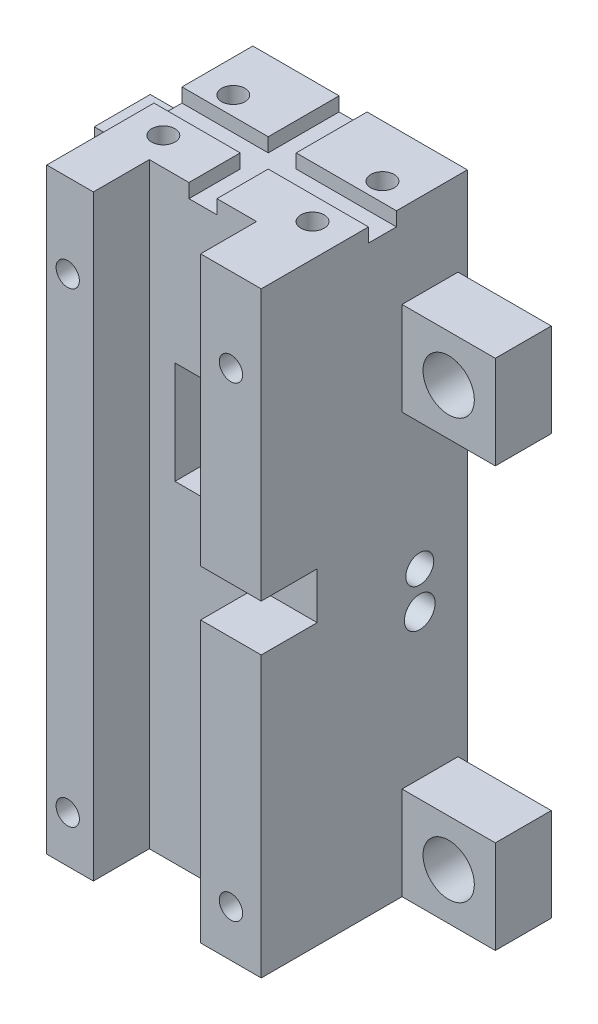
ISO-10303-21;
HEADER;
FILE_DESCRIPTION(('STEP AP214'),'2;1');
FILE_NAME('part.step','',(''),(''),'','','');
FILE_SCHEMA(('AUTOMOTIVE_DESIGN { 1 0 10303 214 1 1 1 1 }'));
ENDSEC;
DATA;
#1=APPLICATION_CONTEXT('core data for automotive mechanical design processes');
#2=APPLICATION_PROTOCOL_DEFINITION('international standard','automotive_design',2000,#1);
#3=PRODUCT_CONTEXT('',#1,'mechanical');
#4=PRODUCT('Part','Part','',(#3));
#5=PRODUCT_RELATED_PRODUCT_CATEGORY('part','',(#4));
#6=PRODUCT_DEFINITION_FORMATION('','',#4);
#7=PRODUCT_DEFINITION_CONTEXT('part definition',#1,'design');
#8=PRODUCT_DEFINITION('design','',#6,#7);
#9=PRODUCT_DEFINITION_SHAPE('','',#8);
#10=(LENGTH_UNIT() NAMED_UNIT(*) SI_UNIT(.MILLI.,.METRE.));
#11=(NAMED_UNIT(*) PLANE_ANGLE_UNIT() SI_UNIT($,.RADIAN.));
#12=(NAMED_UNIT(*) SI_UNIT($,.STERADIAN.) SOLID_ANGLE_UNIT());
#13=UNCERTAINTY_MEASURE_WITH_UNIT(LENGTH_MEASURE(1.E-05),#10,'distance_accuracy_value','');
#14=(GEOMETRIC_REPRESENTATION_CONTEXT(3) GLOBAL_UNCERTAINTY_ASSIGNED_CONTEXT((#13)) GLOBAL_UNIT_ASSIGNED_CONTEXT((#10,
#11,#12)) REPRESENTATION_CONTEXT('',''));
#15=CARTESIAN_POINT('',(0.,0.,0.));
#16=DIRECTION('',(0.,0.,1.));
#17=DIRECTION('',(1.,0.,0.));
#18=AXIS2_PLACEMENT_3D('',#15,#16,#17);
#19=CARTESIAN_POINT('',(-105.888478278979,13.1822327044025,20.1));
#20=DIRECTION('',(1.,0.,0.));
#21=DIRECTION('',(0.,1.,0.));
#22=AXIS2_PLACEMENT_3D('',#19,#20,#21);
#23=PLANE('',#22);
#24=DIRECTION('',(0.,-1.,0.));
#25=VECTOR('',#24,1.);
#26=CARTESIAN_POINT('',(-105.888478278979,-56.8177672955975,-1.));
#27=LINE('',#26,#25);
#28=CARTESIAN_POINT('',(-105.888478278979,-46.8177672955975,-1.));
#29=VERTEX_POINT('',#28);
#30=CARTESIAN_POINT('',(-105.888478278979,-56.8177672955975,-1.));
#31=VERTEX_POINT('',#30);
#32=EDGE_CURVE('E488',#29,#31,#27,.T.);
#33=ORIENTED_EDGE('',*,*,#32,.F.);
#34=DIRECTION('',(0.,0.,-1.));
#35=VECTOR('',#34,1.);
#36=CARTESIAN_POINT('',(-105.888478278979,-46.8177672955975,-1.));
#37=LINE('',#36,#35);
#38=CARTESIAN_POINT('',(-105.888478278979,-46.8177672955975,5.));
#39=VERTEX_POINT('',#38);
#40=EDGE_CURVE('E493',#39,#29,#37,.T.);
#41=ORIENTED_EDGE('',*,*,#40,.F.);
#42=DIRECTION('',(0.,1.,0.));
#43=VECTOR('',#42,1.);
#44=CARTESIAN_POINT('',(-105.888478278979,-56.8177672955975,5.));
#45=LINE('',#44,#43);
#46=CARTESIAN_POINT('',(-105.888478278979,-56.8177672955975,5.));
#47=VERTEX_POINT('',#46);
#48=EDGE_CURVE('E507',#47,#39,#45,.T.);
#49=ORIENTED_EDGE('',*,*,#48,.F.);
#50=DIRECTION('',(0.,0.,-1.));
#51=VECTOR('',#50,1.);
#52=CARTESIAN_POINT('',(-105.888478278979,-56.8177672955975,20.1));
#53=LINE('',#52,#51);
#54=CARTESIAN_POINT('',(-105.888478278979,-56.8177672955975,20.1));
#55=VERTEX_POINT('',#54);
#56=EDGE_CURVE('E531',#55,#47,#53,.T.);
#57=ORIENTED_EDGE('',*,*,#56,.F.);
#58=DIRECTION('',(0.,-1.,0.));
#59=VECTOR('',#58,1.);
#60=CARTESIAN_POINT('',(-105.888478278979,13.1822327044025,20.1));
#61=LINE('',#60,#59);
#62=CARTESIAN_POINT('',(-105.888478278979,7.18223270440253,20.1));
#63=VERTEX_POINT('',#62);
#64=EDGE_CURVE('E1037',#63,#55,#61,.T.);
#65=ORIENTED_EDGE('',*,*,#64,.F.);
#66=DIRECTION('',(0.,0.,-1.));
#67=VECTOR('',#66,1.);
#68=CARTESIAN_POINT('',(-105.888478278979,7.18223270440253,20.1));
#69=LINE('',#68,#67);
#70=CARTESIAN_POINT('',(-105.888478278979,7.18223270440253,8.6));
#71=VERTEX_POINT('',#70);
#72=EDGE_CURVE('E999',#63,#71,#69,.T.);
#73=ORIENTED_EDGE('',*,*,#72,.T.);
#74=DIRECTION('',(0.,-1.,0.));
#75=VECTOR('',#74,1.);
#76=CARTESIAN_POINT('',(-105.888478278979,5.68223270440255,8.6));
#77=LINE('',#76,#75);
#78=CARTESIAN_POINT('',(-105.888478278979,5.68223270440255,8.6));
#79=VERTEX_POINT('',#78);
#80=EDGE_CURVE('E923',#71,#79,#77,.T.);
#81=ORIENTED_EDGE('',*,*,#80,.T.);
#82=DIRECTION('',(0.,0.,-1.));
#83=VECTOR('',#82,1.);
#84=CARTESIAN_POINT('',(-105.888478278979,5.68223270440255,8.6));
#85=LINE('',#84,#83);
#86=CARTESIAN_POINT('',(-105.888478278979,5.68223270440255,5.6));
#87=VERTEX_POINT('',#86);
#88=EDGE_CURVE('E926',#79,#87,#85,.T.);
#89=ORIENTED_EDGE('',*,*,#88,.T.);
#90=DIRECTION('',(0.,1.,0.));
#91=VECTOR('',#90,1.);
#92=CARTESIAN_POINT('',(-105.888478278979,5.68223270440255,5.6));
#93=LINE('',#92,#91);
#94=CARTESIAN_POINT('',(-105.888478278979,7.18223270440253,5.6));
#95=VERTEX_POINT('',#94);
#96=EDGE_CURVE('E930',#87,#95,#93,.T.);
#97=ORIENTED_EDGE('',*,*,#96,.T.);
#98=CARTESIAN_POINT('',(-105.888478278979,7.18223270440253,-2.));
#99=VERTEX_POINT('',#98);
#100=EDGE_CURVE('E998',#95,#99,#69,.T.);
#101=ORIENTED_EDGE('',*,*,#100,.T.);
#102=DIRECTION('',(0.,1.,0.));
#103=VECTOR('',#102,1.);
#104=CARTESIAN_POINT('',(-105.888478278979,-56.8177672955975,-2.));
#105=LINE('',#104,#103);
#106=CARTESIAN_POINT('',(-105.888478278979,-56.8177672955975,-2.));
#107=VERTEX_POINT('',#106);
#108=EDGE_CURVE('E877',#107,#99,#105,.T.);
#109=ORIENTED_EDGE('',*,*,#108,.F.);
#110=EDGE_CURVE('E514',#31,#107,#53,.T.);
#111=ORIENTED_EDGE('',*,*,#110,.F.);
#112=EDGE_LOOP('',(#33,#41,#49,#57,#65,#73,#81,#89,#97,#101,#109,#111));
#113=FACE_BOUND('',#112,.T.);
#114=CARTESIAN_POINT('',(-105.888478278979,-31.3177672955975,3.09999999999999));
#115=DIRECTION('',(-1.,0.,0.));
#116=DIRECTION('',(0.,0.,1.));
#117=AXIS2_PLACEMENT_3D('',#114,#115,#116);
#118=CIRCLE('',#117,1.65);
#119=CARTESIAN_POINT('',(-105.888478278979,-31.3177672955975,4.74999999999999));
#120=VERTEX_POINT('',#119);
#121=EDGE_CURVE('E726',#120,#120,#118,.T.);
#122=ORIENTED_EDGE('',*,*,#121,.F.);
#123=EDGE_LOOP('',(#122));
#124=FACE_BOUND('',#123,.T.);
#125=CARTESIAN_POINT('',(-105.888478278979,-27.3177672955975,3.1));
#126=DIRECTION('',(1.,0.,0.));
#127=DIRECTION('',(0.,0.,-1.));
#128=AXIS2_PLACEMENT_3D('',#125,#126,#127);
#129=CIRCLE('',#128,1.5);
#130=CARTESIAN_POINT('',(-105.888478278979,-27.3177672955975,1.6));
#131=VERTEX_POINT('',#130);
#132=EDGE_CURVE('E537',#131,#131,#129,.T.);
#133=ORIENTED_EDGE('',*,*,#132,.T.);
#134=EDGE_LOOP('',(#133));
#135=FACE_BOUND('',#134,.T.);
#136=DIRECTION('',(0.,-1.,0.));
#137=VECTOR('',#136,1.);
#138=CARTESIAN_POINT('',(-105.888478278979,-1.81776729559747,-1.));
#139=LINE('',#138,#137);
#140=CARTESIAN_POINT('',(-105.888478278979,-1.81776729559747,-1.));
#141=VERTEX_POINT('',#140);
#142=CARTESIAN_POINT('',(-105.888478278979,-11.8177672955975,-0.999999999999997));
#143=VERTEX_POINT('',#142);
#144=EDGE_CURVE('E455',#141,#143,#139,.T.);
#145=ORIENTED_EDGE('',*,*,#144,.F.);
#146=DIRECTION('',(0.,0.,-1.));
#147=VECTOR('',#146,1.);
#148=CARTESIAN_POINT('',(-105.888478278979,-1.81776729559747,-1.));
#149=LINE('',#148,#147);
#150=CARTESIAN_POINT('',(-105.888478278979,-1.81776729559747,5.));
#151=VERTEX_POINT('',#150);
#152=EDGE_CURVE('E460',#151,#141,#149,.T.);
#153=ORIENTED_EDGE('',*,*,#152,.F.);
#154=DIRECTION('',(0.,1.,0.));
#155=VECTOR('',#154,1.);
#156=CARTESIAN_POINT('',(-105.888478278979,-1.81776729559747,5.));
#157=LINE('',#156,#155);
#158=CARTESIAN_POINT('',(-105.888478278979,-11.8177672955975,5.));
#159=VERTEX_POINT('',#158);
#160=EDGE_CURVE('E472',#159,#151,#157,.T.);
#161=ORIENTED_EDGE('',*,*,#160,.F.);
#162=DIRECTION('',(0.,0.,1.));
#163=VECTOR('',#162,1.);
#164=CARTESIAN_POINT('',(-105.888478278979,-11.8177672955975,-0.999999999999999));
#165=LINE('',#164,#163);
#166=EDGE_CURVE('E469',#143,#159,#165,.T.);
#167=ORIENTED_EDGE('',*,*,#166,.F.);
#168=EDGE_LOOP('',(#145,#153,#161,#167));
#169=FACE_BOUND('',#168,.T.);
#170=ADVANCED_FACE('F48',(#113,#124,#135,#169),#23,.F.);
#171=CARTESIAN_POINT('',(-82.8884782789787,7.18223270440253,0.));
#172=DIRECTION('',(0.,-1.,0.));
#173=DIRECTION('',(1.,0.,0.));
#174=AXIS2_PLACEMENT_3D('',#171,#172,#173);
#175=PLANE('',#174);
#176=CARTESIAN_POINT('',(-86.3884782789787,7.18223270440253,11.1));
#177=DIRECTION('',(0.,1.,0.));
#178=DIRECTION('',(0.,0.,1.));
#179=AXIS2_PLACEMENT_3D('',#176,#177,#178);
#180=CIRCLE('',#179,1.24999999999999);
#181=CARTESIAN_POINT('',(-86.3884782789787,7.18223270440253,12.35));
#182=VERTEX_POINT('',#181);
#183=EDGE_CURVE('E898',#182,#182,#180,.T.);
#184=ORIENTED_EDGE('',*,*,#183,.F.);
#185=EDGE_LOOP('',(#184));
#186=FACE_BOUND('',#185,.T.);
#187=DIRECTION('',(0.,0.,1.));
#188=VECTOR('',#187,1.);
#189=CARTESIAN_POINT('',(-82.8884782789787,7.18223270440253,0.));
#190=LINE('',#189,#188);
#191=CARTESIAN_POINT('',(-82.8884782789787,7.18223270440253,8.6));
#192=VERTEX_POINT('',#191);
#193=CARTESIAN_POINT('',(-82.8884782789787,7.18223270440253,20.1));
#194=VERTEX_POINT('',#193);
#195=EDGE_CURVE('E991',#192,#194,#190,.T.);
#196=ORIENTED_EDGE('',*,*,#195,.F.);
#197=DIRECTION('',(1.,0.,0.));
#198=VECTOR('',#197,1.);
#199=CARTESIAN_POINT('',(-105.888478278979,7.18223270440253,8.6));
#200=LINE('',#199,#198);
#201=CARTESIAN_POINT('',(-93.6384782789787,7.18223270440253,8.6));
#202=VERTEX_POINT('',#201);
#203=EDGE_CURVE('E943',#202,#192,#200,.T.);
#204=ORIENTED_EDGE('',*,*,#203,.F.);
#205=DIRECTION('',(0.,0.,1.));
#206=VECTOR('',#205,1.);
#207=CARTESIAN_POINT('',(-93.6384782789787,7.18223270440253,0.));
#208=LINE('',#207,#206);
#209=CARTESIAN_POINT('',(-93.6384782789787,7.18223270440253,14.1));
#210=VERTEX_POINT('',#209);
#211=EDGE_CURVE('E967',#202,#210,#208,.T.);
#212=ORIENTED_EDGE('',*,*,#211,.T.);
#213=DIRECTION('',(-1.,0.,0.));
#214=VECTOR('',#213,1.);
#215=CARTESIAN_POINT('',(-100.888478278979,7.18223270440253,14.1));
#216=LINE('',#215,#214);
#217=CARTESIAN_POINT('',(-89.3884782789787,7.18223270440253,14.1));
#218=VERTEX_POINT('',#217);
#219=EDGE_CURVE('E992',#218,#210,#216,.T.);
#220=ORIENTED_EDGE('',*,*,#219,.F.);
#221=DIRECTION('',(0.,0.,-1.));
#222=VECTOR('',#221,1.);
#223=CARTESIAN_POINT('',(-89.3884782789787,7.18223270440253,-56.8383535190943));
#224=LINE('',#223,#222);
#225=CARTESIAN_POINT('',(-89.3884782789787,7.18223270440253,20.1));
#226=VERTEX_POINT('',#225);
#227=EDGE_CURVE('E1047',#226,#218,#224,.T.);
#228=ORIENTED_EDGE('',*,*,#227,.F.);
#229=DIRECTION('',(1.,0.,0.));
#230=VECTOR('',#229,1.);
#231=CARTESIAN_POINT('',(-82.8884782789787,7.18223270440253,20.1));
#232=LINE('',#231,#230);
#233=EDGE_CURVE('E971',#226,#194,#232,.T.);
#234=ORIENTED_EDGE('',*,*,#233,.T.);
#235=EDGE_LOOP('',(#196,#204,#212,#220,#228,#234));
#236=FACE_BOUND('',#235,.T.);
#237=ADVANCED_FACE('F675',(#186,#236),#175,.F.);
#238=CARTESIAN_POINT('',(-102.388478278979,7.18223270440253,11.1));
#239=DIRECTION('',(0.,1.,0.));
#240=DIRECTION('',(0.,0.,1.));
#241=AXIS2_PLACEMENT_3D('',#238,#239,#240);
#242=CIRCLE('',#241,1.24999999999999);
#243=CARTESIAN_POINT('',(-102.388478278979,7.18223270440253,12.35));
#244=VERTEX_POINT('',#243);
#245=EDGE_CURVE('E897',#244,#244,#242,.T.);
#246=ORIENTED_EDGE('',*,*,#245,.F.);
#247=EDGE_LOOP('',(#246));
#248=FACE_BOUND('',#247,.T.);
#249=DIRECTION('',(0.,0.,1.));
#250=VECTOR('',#249,1.);
#251=CARTESIAN_POINT('',(-96.6384782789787,7.18223270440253,0.));
#252=LINE('',#251,#250);
#253=CARTESIAN_POINT('',(-96.6384782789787,7.18223270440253,8.6));
#254=VERTEX_POINT('',#253);
#255=CARTESIAN_POINT('',(-96.6384782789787,7.18223270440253,14.1));
#256=VERTEX_POINT('',#255);
#257=EDGE_CURVE('E980',#254,#256,#252,.T.);
#258=ORIENTED_EDGE('',*,*,#257,.F.);
#259=EDGE_CURVE('E940',#71,#254,#200,.T.);
#260=ORIENTED_EDGE('',*,*,#259,.F.);
#261=ORIENTED_EDGE('',*,*,#72,.F.);
#262=CARTESIAN_POINT('',(-100.888478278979,7.18223270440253,20.1));
#263=VERTEX_POINT('',#262);
#264=EDGE_CURVE('E986',#63,#263,#232,.T.);
#265=ORIENTED_EDGE('',*,*,#264,.T.);
#266=DIRECTION('',(0.,0.,1.));
#267=VECTOR('',#266,1.);
#268=CARTESIAN_POINT('',(-100.888478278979,7.18223270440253,0.));
#269=LINE('',#268,#267);
#270=CARTESIAN_POINT('',(-100.888478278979,7.18223270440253,14.1));
#271=VERTEX_POINT('',#270);
#272=EDGE_CURVE('E995',#271,#263,#269,.T.);
#273=ORIENTED_EDGE('',*,*,#272,.F.);
#274=EDGE_CURVE('E990',#256,#271,#216,.T.);
#275=ORIENTED_EDGE('',*,*,#274,.F.);
#276=EDGE_LOOP('',(#258,#260,#261,#265,#273,#275));
#277=FACE_BOUND('',#276,.T.);
#278=ADVANCED_FACE('F719',(#248,#277),#175,.F.);
#279=CARTESIAN_POINT('',(-93.6384782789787,5.68223270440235,0.));
#280=DIRECTION('',(1.,0.,0.));
#281=DIRECTION('',(0.,0.,-1.));
#282=AXIS2_PLACEMENT_3D('',#279,#280,#281);
#283=PLANE('',#282);
#284=ORIENTED_EDGE('',*,*,#211,.F.);
#285=DIRECTION('',(0.,-1.,0.));
#286=VECTOR('',#285,1.);
#287=CARTESIAN_POINT('',(-93.6384782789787,5.68223270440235,8.6));
#288=LINE('',#287,#286);
#289=CARTESIAN_POINT('',(-93.6384782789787,5.68223270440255,8.6));
#290=VERTEX_POINT('',#289);
#291=EDGE_CURVE('E955',#202,#290,#288,.T.);
#292=ORIENTED_EDGE('',*,*,#291,.T.);
#293=DIRECTION('',(0.,0.,1.));
#294=VECTOR('',#293,1.);
#295=CARTESIAN_POINT('',(-93.6384782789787,5.68223270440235,0.));
#296=LINE('',#295,#294);
#297=CARTESIAN_POINT('',(-93.6384782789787,5.68223270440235,14.1));
#298=VERTEX_POINT('',#297);
#299=EDGE_CURVE('E972',#290,#298,#296,.T.);
#300=ORIENTED_EDGE('',*,*,#299,.T.);
#301=DIRECTION('',(0.,1.,0.));
#302=VECTOR('',#301,1.);
#303=CARTESIAN_POINT('',(-93.6384782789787,5.68223270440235,14.1));
#304=LINE('',#303,#302);
#305=EDGE_CURVE('E958',#298,#210,#304,.T.);
#306=ORIENTED_EDGE('',*,*,#305,.T.);
#307=EDGE_LOOP('',(#284,#292,#300,#306));
#308=FACE_BOUND('',#307,.T.);
#309=ADVANCED_FACE('F670',(#308),#283,.F.);
#310=CARTESIAN_POINT('',(-96.6384782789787,5.68223270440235,0.));
#311=DIRECTION('',(-1.,0.,0.));
#312=DIRECTION('',(0.,0.,1.));
#313=AXIS2_PLACEMENT_3D('',#310,#311,#312);
#314=PLANE('',#313);
#315=DIRECTION('',(0.,0.,1.));
#316=VECTOR('',#315,1.);
#317=CARTESIAN_POINT('',(-96.6384782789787,5.68223270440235,0.));
#318=LINE('',#317,#316);
#319=CARTESIAN_POINT('',(-96.6384782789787,5.68223270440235,8.6));
#320=VERTEX_POINT('',#319);
#321=CARTESIAN_POINT('',(-96.6384782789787,5.68223270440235,14.1));
#322=VERTEX_POINT('',#321);
#323=EDGE_CURVE('E976',#320,#322,#318,.T.);
#324=ORIENTED_EDGE('',*,*,#323,.F.);
#325=DIRECTION('',(0.,1.,0.));
#326=VECTOR('',#325,1.);
#327=CARTESIAN_POINT('',(-96.6384782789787,5.68223270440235,8.6));
#328=LINE('',#327,#326);
#329=EDGE_CURVE('E619',#320,#254,#328,.T.);
#330=ORIENTED_EDGE('',*,*,#329,.T.);
#331=ORIENTED_EDGE('',*,*,#257,.T.);
#332=DIRECTION('',(0.,-1.,0.));
#333=VECTOR('',#332,1.);
#334=CARTESIAN_POINT('',(-96.6384782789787,5.68223270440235,14.1));
#335=LINE('',#334,#333);
#336=EDGE_CURVE('E961',#256,#322,#335,.T.);
#337=ORIENTED_EDGE('',*,*,#336,.T.);
#338=EDGE_LOOP('',(#324,#330,#331,#337));
#339=FACE_BOUND('',#338,.T.);
#340=ADVANCED_FACE('F665',(#339),#314,.F.);
#341=CARTESIAN_POINT('',(-86.3884782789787,7.18223270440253,3.6));
#342=DIRECTION('',(0.,1.,0.));
#343=DIRECTION('',(0.,0.,1.));
#344=AXIS2_PLACEMENT_3D('',#341,#342,#343);
#345=CIRCLE('',#344,1.24999999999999);
#346=CARTESIAN_POINT('',(-86.3884782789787,7.18223270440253,4.84999999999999));
#347=VERTEX_POINT('',#346);
#348=EDGE_CURVE('E916',#347,#347,#345,.T.);
#349=ORIENTED_EDGE('',*,*,#348,.F.);
#350=EDGE_LOOP('',(#349));
#351=FACE_BOUND('',#350,.T.);
#352=CARTESIAN_POINT('',(-93.6384782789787,7.18223270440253,-2.));
#353=VERTEX_POINT('',#352);
#354=CARTESIAN_POINT('',(-93.6384782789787,7.18223270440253,5.6));
#355=VERTEX_POINT('',#354);
#356=EDGE_CURVE('E981',#353,#355,#208,.T.);
#357=ORIENTED_EDGE('',*,*,#356,.T.);
#358=DIRECTION('',(1.,0.,0.));
#359=VECTOR('',#358,1.);
#360=CARTESIAN_POINT('',(-105.888478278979,7.18223270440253,5.6));
#361=LINE('',#360,#359);
#362=CARTESIAN_POINT('',(-82.8884782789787,7.18223270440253,5.6));
#363=VERTEX_POINT('',#362);
#364=EDGE_CURVE('E947',#355,#363,#361,.T.);
#365=ORIENTED_EDGE('',*,*,#364,.T.);
#366=CARTESIAN_POINT('',(-82.8884782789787,7.18223270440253,-2.));
#367=VERTEX_POINT('',#366);
#368=EDGE_CURVE('E987',#367,#363,#190,.T.);
#369=ORIENTED_EDGE('',*,*,#368,.F.);
#370=DIRECTION('',(1.,0.,0.));
#371=VECTOR('',#370,1.);
#372=CARTESIAN_POINT('',(-93.6384782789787,7.18223270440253,-2.));
#373=LINE('',#372,#371);
#374=EDGE_CURVE('E867',#353,#367,#373,.T.);
#375=ORIENTED_EDGE('',*,*,#374,.F.);
#376=EDGE_LOOP('',(#357,#365,#369,#375));
#377=FACE_BOUND('',#376,.T.);
#378=ADVANCED_FACE('F676',(#351,#377),#175,.F.);
#379=CARTESIAN_POINT('',(0.,0.,20.1));
#380=DIRECTION('',(0.,0.,1.));
#381=DIRECTION('',(1.,0.,0.));
#382=AXIS2_PLACEMENT_3D('',#379,#380,#381);
#383=PLANE('',#382);
#384=CARTESIAN_POINT('',(-86.1384782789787,-1.81776729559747,20.1));
#385=DIRECTION('',(0.,0.,1.));
#386=DIRECTION('',(1.,0.,0.));
#387=AXIS2_PLACEMENT_3D('',#384,#385,#386);
#388=CIRCLE('',#387,1.24999999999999);
#389=CARTESIAN_POINT('',(-84.8884782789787,-1.81776729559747,20.1));
#390=VERTEX_POINT('',#389);
#391=EDGE_CURVE('E882',#390,#390,#388,.T.);
#392=ORIENTED_EDGE('',*,*,#391,.F.);
#393=EDGE_LOOP('',(#392));
#394=FACE_BOUND('',#393,.T.);
#395=ORIENTED_EDGE('',*,*,#233,.F.);
#396=DIRECTION('',(0.,1.,0.));
#397=VECTOR('',#396,1.);
#398=CARTESIAN_POINT('',(-89.3884782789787,-56.8177672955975,20.1));
#399=LINE('',#398,#397);
#400=CARTESIAN_POINT('',(-89.3884782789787,-21.8177672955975,20.1));
#401=VERTEX_POINT('',#400);
#402=EDGE_CURVE('E1002',#401,#226,#399,.T.);
#403=ORIENTED_EDGE('',*,*,#402,.F.);
#404=DIRECTION('',(1.,0.,0.));
#405=VECTOR('',#404,1.);
#406=CARTESIAN_POINT('',(-100.888478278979,-21.8177672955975,20.1));
#407=LINE('',#406,#405);
#408=CARTESIAN_POINT('',(-82.8884782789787,-21.8177672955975,20.1));
#409=VERTEX_POINT('',#408);
#410=EDGE_CURVE('E1035',#401,#409,#407,.T.);
#411=ORIENTED_EDGE('',*,*,#410,.T.);
#412=DIRECTION('',(0.,1.,0.));
#413=VECTOR('',#412,1.);
#414=CARTESIAN_POINT('',(-82.8884782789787,13.1822327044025,20.1));
#415=LINE('',#414,#413);
#416=EDGE_CURVE('E1066',#409,#194,#415,.T.);
#417=ORIENTED_EDGE('',*,*,#416,.T.);
#418=EDGE_LOOP('',(#395,#403,#411,#417));
#419=FACE_BOUND('',#418,.T.);
#420=ADVANCED_FACE('F702',(#394,#419),#383,.T.);
#421=CARTESIAN_POINT('',(-86.1384782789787,-51.8177672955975,20.1));
#422=DIRECTION('',(0.,0.,1.));
#423=DIRECTION('',(1.,0.,0.));
#424=AXIS2_PLACEMENT_3D('',#421,#422,#423);
#425=CIRCLE('',#424,1.24999999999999);
#426=CARTESIAN_POINT('',(-84.8884782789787,-51.8177672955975,20.1));
#427=VERTEX_POINT('',#426);
#428=EDGE_CURVE('E598',#427,#427,#425,.T.);
#429=ORIENTED_EDGE('',*,*,#428,.F.);
#430=EDGE_LOOP('',(#429));
#431=FACE_BOUND('',#430,.T.);
#432=CARTESIAN_POINT('',(-89.3884782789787,-56.8177672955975,20.1));
#433=VERTEX_POINT('',#432);
#434=CARTESIAN_POINT('',(-89.3884782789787,-26.8177672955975,20.1));
#435=VERTEX_POINT('',#434);
#436=EDGE_CURVE('E1003',#433,#435,#399,.T.);
#437=ORIENTED_EDGE('',*,*,#436,.F.);
#438=DIRECTION('',(1.,0.,0.));
#439=VECTOR('',#438,1.);
#440=CARTESIAN_POINT('',(-105.888478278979,-56.8177672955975,20.1));
#441=LINE('',#440,#439);
#442=CARTESIAN_POINT('',(-82.8884782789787,-56.8177672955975,20.1));
#443=VERTEX_POINT('',#442);
#444=EDGE_CURVE('E1046',#433,#443,#441,.T.);
#445=ORIENTED_EDGE('',*,*,#444,.T.);
#446=CARTESIAN_POINT('',(-82.8884782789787,-26.8177672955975,20.1));
#447=VERTEX_POINT('',#446);
#448=EDGE_CURVE('E520',#443,#447,#415,.T.);
#449=ORIENTED_EDGE('',*,*,#448,.T.);
#450=DIRECTION('',(1.,0.,0.));
#451=VECTOR('',#450,1.);
#452=CARTESIAN_POINT('',(-100.888478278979,-26.8177672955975,20.1));
#453=LINE('',#452,#451);
#454=EDGE_CURVE('E1027',#435,#447,#453,.T.);
#455=ORIENTED_EDGE('',*,*,#454,.F.);
#456=EDGE_LOOP('',(#437,#445,#449,#455));
#457=FACE_BOUND('',#456,.T.);
#458=ADVANCED_FACE('F703',(#431,#457),#383,.T.);
#459=CARTESIAN_POINT('',(-105.888478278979,-56.8177672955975,20.1));
#460=DIRECTION('',(0.,1.,0.));
#461=DIRECTION('',(0.,0.,1.));
#462=AXIS2_PLACEMENT_3D('',#459,#460,#461);
#463=PLANE('',#462);
#464=DIRECTION('',(-1.,0.,0.));
#465=VECTOR('',#464,1.);
#466=CARTESIAN_POINT('',(-82.8884782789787,-56.8177672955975,-2.));
#467=LINE('',#466,#465);
#468=CARTESIAN_POINT('',(-98.1384782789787,-56.8177672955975,-2.));
#469=VERTEX_POINT('',#468);
#470=EDGE_CURVE('E873',#469,#107,#467,.T.);
#471=ORIENTED_EDGE('',*,*,#470,.F.);
#472=DIRECTION('',(0.,0.,-1.));
#473=VECTOR('',#472,1.);
#474=CARTESIAN_POINT('',(-98.1384782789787,-56.8177672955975,8.));
#475=LINE('',#474,#473);
#476=CARTESIAN_POINT('',(-98.1384782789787,-56.8177672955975,8.));
#477=VERTEX_POINT('',#476);
#478=EDGE_CURVE('E836',#477,#469,#475,.T.);
#479=ORIENTED_EDGE('',*,*,#478,.F.);
#480=DIRECTION('',(-1.,0.,0.));
#481=VECTOR('',#480,1.);
#482=CARTESIAN_POINT('',(-98.1384782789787,-56.8177672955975,8.));
#483=LINE('',#482,#481);
#484=CARTESIAN_POINT('',(-92.1384782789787,-56.8177672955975,8.));
#485=VERTEX_POINT('',#484);
#486=EDGE_CURVE('E1127',#485,#477,#483,.T.);
#487=ORIENTED_EDGE('',*,*,#486,.F.);
#488=DIRECTION('',(0.,0.,-1.));
#489=VECTOR('',#488,1.);
#490=CARTESIAN_POINT('',(-92.1384782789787,-56.8177672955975,8.));
#491=LINE('',#490,#489);
#492=CARTESIAN_POINT('',(-92.1384782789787,-56.8177672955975,-2.));
#493=VERTEX_POINT('',#492);
#494=EDGE_CURVE('E1130',#485,#493,#491,.T.);
#495=ORIENTED_EDGE('',*,*,#494,.T.);
#496=CARTESIAN_POINT('',(-82.8884782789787,-56.8177672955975,-2.));
#497=VERTEX_POINT('',#496);
#498=EDGE_CURVE('E874',#497,#493,#467,.T.);
#499=ORIENTED_EDGE('',*,*,#498,.F.);
#500=DIRECTION('',(0.,0.,-1.));
#501=VECTOR('',#500,1.);
#502=CARTESIAN_POINT('',(-82.8884782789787,-56.8177672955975,20.1));
#503=LINE('',#502,#501);
#504=CARTESIAN_POINT('',(-82.8884782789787,-56.8177672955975,-1.));
#505=VERTEX_POINT('',#504);
#506=EDGE_CURVE('E515',#505,#497,#503,.T.);
#507=ORIENTED_EDGE('',*,*,#506,.F.);
#508=DIRECTION('',(-1.,0.,0.));
#509=VECTOR('',#508,1.);
#510=CARTESIAN_POINT('',(-72.8884782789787,-56.8177672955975,-1.));
#511=LINE('',#510,#509);
#512=CARTESIAN_POINT('',(-72.8884782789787,-56.8177672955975,-1.));
#513=VERTEX_POINT('',#512);
#514=EDGE_CURVE('E444',#513,#505,#511,.T.);
#515=ORIENTED_EDGE('',*,*,#514,.F.);
#516=DIRECTION('',(0.,0.,1.));
#517=VECTOR('',#516,1.);
#518=CARTESIAN_POINT('',(-72.8884782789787,-56.8177672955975,-1.));
#519=LINE('',#518,#517);
#520=CARTESIAN_POINT('',(-72.8884782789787,-56.8177672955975,5.));
#521=VERTEX_POINT('',#520);
#522=EDGE_CURVE('E442',#513,#521,#519,.T.);
#523=ORIENTED_EDGE('',*,*,#522,.T.);
#524=DIRECTION('',(-1.,0.,0.));
#525=VECTOR('',#524,1.);
#526=CARTESIAN_POINT('',(-72.8884782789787,-56.8177672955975,5.));
#527=LINE('',#526,#525);
#528=CARTESIAN_POINT('',(-82.8884782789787,-56.8177672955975,5.));
#529=VERTEX_POINT('',#528);
#530=EDGE_CURVE('E453',#521,#529,#527,.T.);
#531=ORIENTED_EDGE('',*,*,#530,.T.);
#532=EDGE_CURVE('E510',#443,#529,#503,.T.);
#533=ORIENTED_EDGE('',*,*,#532,.F.);
#534=ORIENTED_EDGE('',*,*,#444,.F.);
#535=DIRECTION('',(0.,0.,1.));
#536=VECTOR('',#535,1.);
#537=CARTESIAN_POINT('',(-89.3884782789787,-56.8177672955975,-56.8383535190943));
#538=LINE('',#537,#536);
#539=CARTESIAN_POINT('',(-89.3884782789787,-56.8177672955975,14.1));
#540=VERTEX_POINT('',#539);
#541=EDGE_CURVE('E1008',#540,#433,#538,.T.);
#542=ORIENTED_EDGE('',*,*,#541,.F.);
#543=DIRECTION('',(1.,0.,0.));
#544=VECTOR('',#543,1.);
#545=CARTESIAN_POINT('',(-100.888478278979,-56.8177672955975,14.1));
#546=LINE('',#545,#544);
#547=CARTESIAN_POINT('',(-100.888478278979,-56.8177672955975,14.1));
#548=VERTEX_POINT('',#547);
#549=EDGE_CURVE('E1005',#548,#540,#546,.T.);
#550=ORIENTED_EDGE('',*,*,#549,.F.);
#551=DIRECTION('',(0.,0.,1.));
#552=VECTOR('',#551,1.);
#553=CARTESIAN_POINT('',(-100.888478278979,-56.8177672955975,-56.8383535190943));
#554=LINE('',#553,#552);
#555=CARTESIAN_POINT('',(-100.888478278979,-56.8177672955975,20.1));
#556=VERTEX_POINT('',#555);
#557=EDGE_CURVE('E1012',#548,#556,#554,.T.);
#558=ORIENTED_EDGE('',*,*,#557,.T.);
#559=EDGE_CURVE('E1044',#55,#556,#441,.T.);
#560=ORIENTED_EDGE('',*,*,#559,.F.);
#561=ORIENTED_EDGE('',*,*,#56,.T.);
#562=DIRECTION('',(1.,0.,0.));
#563=VECTOR('',#562,1.);
#564=CARTESIAN_POINT('',(-115.888478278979,-56.8177672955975,5.));
#565=LINE('',#564,#563);
#566=CARTESIAN_POINT('',(-115.888478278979,-56.8177672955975,5.));
#567=VERTEX_POINT('',#566);
#568=EDGE_CURVE('E1089',#567,#47,#565,.T.);
#569=ORIENTED_EDGE('',*,*,#568,.F.);
#570=DIRECTION('',(0.,0.,1.));
#571=VECTOR('',#570,1.);
#572=CARTESIAN_POINT('',(-115.888478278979,-56.8177672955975,-1.));
#573=LINE('',#572,#571);
#574=CARTESIAN_POINT('',(-115.888478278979,-56.8177672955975,-1.));
#575=VERTEX_POINT('',#574);
#576=EDGE_CURVE('E492',#575,#567,#573,.T.);
#577=ORIENTED_EDGE('',*,*,#576,.F.);
#578=DIRECTION('',(1.,0.,0.));
#579=VECTOR('',#578,1.);
#580=CARTESIAN_POINT('',(-115.888478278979,-56.8177672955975,-1.));
#581=LINE('',#580,#579);
#582=EDGE_CURVE('E1091',#575,#31,#581,.T.);
#583=ORIENTED_EDGE('',*,*,#582,.T.);
#584=ORIENTED_EDGE('',*,*,#110,.T.);
#585=EDGE_LOOP('',(#471,#479,#487,#495,#499,#507,#515,#523,#531,#533,#534,#542,#550,#558,#560,
#561,#569,#577,#583,#584));
#586=FACE_BOUND('',#585,.T.);
#587=ADVANCED_FACE('F705',(#586),#463,.F.);
#588=CARTESIAN_POINT('',(-82.8884782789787,13.1822327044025,20.1));
#589=DIRECTION('',(-1.,0.,0.));
#590=DIRECTION('',(0.,0.,1.));
#591=AXIS2_PLACEMENT_3D('',#588,#589,#590);
#592=PLANE('',#591);
#593=DIRECTION('',(0.,0.,-1.));
#594=VECTOR('',#593,1.);
#595=CARTESIAN_POINT('',(-82.8884782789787,-1.81776729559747,-1.));
#596=LINE('',#595,#594);
#597=CARTESIAN_POINT('',(-82.8884782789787,-1.81776729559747,5.));
#598=VERTEX_POINT('',#597);
#599=CARTESIAN_POINT('',(-82.8884782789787,-1.81776729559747,-1.));
#600=VERTEX_POINT('',#599);
#601=EDGE_CURVE('E422',#598,#600,#596,.T.);
#602=ORIENTED_EDGE('',*,*,#601,.T.);
#603=DIRECTION('',(0.,-1.,0.));
#604=VECTOR('',#603,1.);
#605=CARTESIAN_POINT('',(-82.8884782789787,-1.81776729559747,-1.));
#606=LINE('',#605,#604);
#607=CARTESIAN_POINT('',(-82.8884782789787,-11.8177672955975,-0.999999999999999));
#608=VERTEX_POINT('',#607);
#609=EDGE_CURVE('E396',#600,#608,#606,.T.);
#610=ORIENTED_EDGE('',*,*,#609,.T.);
#611=DIRECTION('',(0.,0.,1.));
#612=VECTOR('',#611,1.);
#613=CARTESIAN_POINT('',(-82.8884782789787,-11.8177672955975,-0.999999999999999));
#614=LINE('',#613,#612);
#615=CARTESIAN_POINT('',(-82.8884782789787,-11.8177672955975,5.));
#616=VERTEX_POINT('',#615);
#617=EDGE_CURVE('E411',#608,#616,#614,.T.);
#618=ORIENTED_EDGE('',*,*,#617,.T.);
#619=DIRECTION('',(0.,1.,0.));
#620=VECTOR('',#619,1.);
#621=CARTESIAN_POINT('',(-82.8884782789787,-1.81776729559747,5.));
#622=LINE('',#621,#620);
#623=EDGE_CURVE('E65',#616,#598,#622,.T.);
#624=ORIENTED_EDGE('',*,*,#623,.T.);
#625=EDGE_LOOP('',(#602,#610,#618,#624));
#626=FACE_BOUND('',#625,.T.);
#627=CARTESIAN_POINT('',(-82.8884782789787,-31.3177672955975,3.09999999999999));
#628=DIRECTION('',(1.,0.,0.));
#629=DIRECTION('',(0.,0.,-1.));
#630=AXIS2_PLACEMENT_3D('',#627,#628,#629);
#631=CIRCLE('',#630,1.64999999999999);
#632=CARTESIAN_POINT('',(-82.8884782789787,-31.3177672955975,1.45));
#633=VERTEX_POINT('',#632);
#634=EDGE_CURVE('E1095',#633,#633,#631,.T.);
#635=ORIENTED_EDGE('',*,*,#634,.F.);
#636=EDGE_LOOP('',(#635));
#637=FACE_BOUND('',#636,.T.);
#638=CARTESIAN_POINT('',(-82.8884782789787,-27.3177672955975,3.1));
#639=DIRECTION('',(1.,0.,0.));
#640=DIRECTION('',(0.,0.,-1.));
#641=AXIS2_PLACEMENT_3D('',#638,#639,#640);
#642=CIRCLE('',#641,1.5);
#643=CARTESIAN_POINT('',(-82.8884782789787,-27.3177672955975,1.6));
#644=VERTEX_POINT('',#643);
#645=EDGE_CURVE('E1112',#644,#644,#642,.T.);
#646=ORIENTED_EDGE('',*,*,#645,.F.);
#647=EDGE_LOOP('',(#646));
#648=FACE_BOUND('',#647,.T.);
#649=DIRECTION('',(0.,0.,-1.));
#650=VECTOR('',#649,1.);
#651=CARTESIAN_POINT('',(-82.8884782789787,-46.8177672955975,-1.));
#652=LINE('',#651,#650);
#653=CARTESIAN_POINT('',(-82.8884782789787,-46.8177672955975,5.));
#654=VERTEX_POINT('',#653);
#655=CARTESIAN_POINT('',(-82.8884782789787,-46.8177672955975,-1.));
#656=VERTEX_POINT('',#655);
#657=EDGE_CURVE('E447',#654,#656,#652,.T.);
#658=ORIENTED_EDGE('',*,*,#657,.T.);
#659=DIRECTION('',(0.,-1.,0.));
#660=VECTOR('',#659,1.);
#661=CARTESIAN_POINT('',(-82.8884782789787,-56.8177672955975,-1.));
#662=LINE('',#661,#660);
#663=EDGE_CURVE('E51',#656,#505,#662,.T.);
#664=ORIENTED_EDGE('',*,*,#663,.T.);
#665=ORIENTED_EDGE('',*,*,#506,.T.);
#666=DIRECTION('',(0.,-1.,0.));
#667=VECTOR('',#666,1.);
#668=CARTESIAN_POINT('',(-82.8884782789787,7.18223270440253,-2.));
#669=LINE('',#668,#667);
#670=EDGE_CURVE('E870',#367,#497,#669,.T.);
#671=ORIENTED_EDGE('',*,*,#670,.F.);
#672=ORIENTED_EDGE('',*,*,#368,.T.);
#673=DIRECTION('',(0.,1.,0.));
#674=VECTOR('',#673,1.);
#675=CARTESIAN_POINT('',(-82.8884782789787,5.68223270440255,5.6));
#676=LINE('',#675,#674);
#677=CARTESIAN_POINT('',(-82.8884782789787,5.68223270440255,5.6));
#678=VERTEX_POINT('',#677);
#679=EDGE_CURVE('E927',#678,#363,#676,.T.);
#680=ORIENTED_EDGE('',*,*,#679,.F.);
#681=DIRECTION('',(0.,0.,-1.));
#682=VECTOR('',#681,1.);
#683=CARTESIAN_POINT('',(-82.8884782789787,5.68223270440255,8.6));
#684=LINE('',#683,#682);
#685=CARTESIAN_POINT('',(-82.8884782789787,5.68223270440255,8.6));
#686=VERTEX_POINT('',#685);
#687=EDGE_CURVE('E936',#686,#678,#684,.T.);
#688=ORIENTED_EDGE('',*,*,#687,.F.);
#689=DIRECTION('',(0.,-1.,0.));
#690=VECTOR('',#689,1.);
#691=CARTESIAN_POINT('',(-82.8884782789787,5.68223270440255,8.6));
#692=LINE('',#691,#690);
#693=EDGE_CURVE('E922',#192,#686,#692,.T.);
#694=ORIENTED_EDGE('',*,*,#693,.F.);
#695=ORIENTED_EDGE('',*,*,#195,.T.);
#696=ORIENTED_EDGE('',*,*,#416,.F.);
#697=DIRECTION('',(0.,0.,1.));
#698=VECTOR('',#697,1.);
#699=CARTESIAN_POINT('',(-82.8884782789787,-21.8177672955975,20.1));
#700=LINE('',#699,#698);
#701=CARTESIAN_POINT('',(-82.8884782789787,-21.8177672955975,14.1));
#702=VERTEX_POINT('',#701);
#703=EDGE_CURVE('E1024',#702,#409,#700,.T.);
#704=ORIENTED_EDGE('',*,*,#703,.F.);
#705=DIRECTION('',(0.,1.,0.));
#706=VECTOR('',#705,1.);
#707=CARTESIAN_POINT('',(-82.8884782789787,-26.8177672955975,14.1));
#708=LINE('',#707,#706);
#709=CARTESIAN_POINT('',(-82.8884782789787,-26.8177672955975,14.1));
#710=VERTEX_POINT('',#709);
#711=EDGE_CURVE('E1030',#710,#702,#708,.T.);
#712=ORIENTED_EDGE('',*,*,#711,.F.);
#713=DIRECTION('',(0.,0.,-1.));
#714=VECTOR('',#713,1.);
#715=CARTESIAN_POINT('',(-82.8884782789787,-26.8177672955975,20.1));
#716=LINE('',#715,#714);
#717=EDGE_CURVE('E1020',#447,#710,#716,.T.);
#718=ORIENTED_EDGE('',*,*,#717,.F.);
#719=ORIENTED_EDGE('',*,*,#448,.F.);
#720=ORIENTED_EDGE('',*,*,#532,.T.);
#721=DIRECTION('',(0.,1.,0.));
#722=VECTOR('',#721,1.);
#723=CARTESIAN_POINT('',(-82.8884782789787,-56.8177672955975,5.));
#724=LINE('',#723,#722);
#725=EDGE_CURVE('E436',#529,#654,#724,.T.);
#726=ORIENTED_EDGE('',*,*,#725,.T.);
#727=EDGE_LOOP('',(#658,#664,#665,#671,#672,#680,#688,#694,#695,#696,#704,#712,#718,#719,#720,#726));
#728=FACE_BOUND('',#727,.T.);
#729=ADVANCED_FACE('F700',(#626,#637,#648,#728),#592,.F.);
#730=CARTESIAN_POINT('',(-103.638478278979,-1.81776729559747,20.1));
#731=DIRECTION('',(0.,0.,1.));
#732=DIRECTION('',(1.,0.,0.));
#733=AXIS2_PLACEMENT_3D('',#730,#731,#732);
#734=CIRCLE('',#733,1.24999999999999);
#735=CARTESIAN_POINT('',(-102.388478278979,-1.81776729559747,20.1));
#736=VERTEX_POINT('',#735);
#737=EDGE_CURVE('E584',#736,#736,#734,.T.);
#738=ORIENTED_EDGE('',*,*,#737,.F.);
#739=EDGE_LOOP('',(#738));
#740=FACE_BOUND('',#739,.T.);
#741=CARTESIAN_POINT('',(-103.638478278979,-51.8177672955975,20.1));
#742=DIRECTION('',(0.,0.,1.));
#743=DIRECTION('',(1.,0.,0.));
#744=AXIS2_PLACEMENT_3D('',#741,#742,#743);
#745=CIRCLE('',#744,1.24999999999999);
#746=CARTESIAN_POINT('',(-102.388478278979,-51.8177672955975,20.1));
#747=VERTEX_POINT('',#746);
#748=EDGE_CURVE('E1886',#747,#747,#745,.T.);
#749=ORIENTED_EDGE('',*,*,#748,.F.);
#750=EDGE_LOOP('',(#749));
#751=FACE_BOUND('',#750,.T.);
#752=ORIENTED_EDGE('',*,*,#264,.F.);
#753=ORIENTED_EDGE('',*,*,#64,.T.);
#754=ORIENTED_EDGE('',*,*,#559,.T.);
#755=DIRECTION('',(0.,-1.,0.));
#756=VECTOR('',#755,1.);
#757=CARTESIAN_POINT('',(-100.888478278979,-26.8177672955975,20.1));
#758=LINE('',#757,#756);
#759=EDGE_CURVE('E1021',#263,#556,#758,.T.);
#760=ORIENTED_EDGE('',*,*,#759,.F.);
#761=EDGE_LOOP('',(#752,#753,#754,#760));
#762=FACE_BOUND('',#761,.T.);
#763=ADVANCED_FACE('F690',(#740,#751,#762),#383,.T.);
#764=CARTESIAN_POINT('',(-100.888478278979,-21.8177672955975,20.1));
#765=DIRECTION('',(0.,1.,0.));
#766=DIRECTION('',(0.,0.,1.));
#767=AXIS2_PLACEMENT_3D('',#764,#765,#766);
#768=PLANE('',#767);
#769=ORIENTED_EDGE('',*,*,#410,.F.);
#770=DIRECTION('',(0.,0.,-1.));
#771=VECTOR('',#770,1.);
#772=CARTESIAN_POINT('',(-89.3884782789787,-21.8177672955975,20.1));
#773=LINE('',#772,#771);
#774=CARTESIAN_POINT('',(-89.3884782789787,-21.8177672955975,14.1));
#775=VERTEX_POINT('',#774);
#776=EDGE_CURVE('E1017',#401,#775,#773,.T.);
#777=ORIENTED_EDGE('',*,*,#776,.T.);
#778=DIRECTION('',(1.,0.,0.));
#779=VECTOR('',#778,1.);
#780=CARTESIAN_POINT('',(-100.888478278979,-21.8177672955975,14.1));
#781=LINE('',#780,#779);
#782=EDGE_CURVE('E1038',#775,#702,#781,.T.);
#783=ORIENTED_EDGE('',*,*,#782,.T.);
#784=ORIENTED_EDGE('',*,*,#703,.T.);
#785=EDGE_LOOP('',(#769,#777,#783,#784));
#786=FACE_BOUND('',#785,.T.);
#787=ADVANCED_FACE('F686',(#786),#768,.F.);
#788=CARTESIAN_POINT('',(-100.888478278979,-26.8177672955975,14.1));
#789=DIRECTION('',(0.,0.,-1.));
#790=DIRECTION('',(0.,1.,0.));
#791=AXIS2_PLACEMENT_3D('',#788,#789,#790);
#792=PLANE('',#791);
#793=DIRECTION('',(1.,0.,0.));
#794=VECTOR('',#793,1.);
#795=CARTESIAN_POINT('',(-98.1384782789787,-21.3177672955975,14.1));
#796=LINE('',#795,#794);
#797=CARTESIAN_POINT('',(-98.1384782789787,-21.3177672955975,14.1));
#798=VERTEX_POINT('',#797);
#799=CARTESIAN_POINT('',(-92.1384782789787,-21.3177672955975,14.1));
#800=VERTEX_POINT('',#799);
#801=EDGE_CURVE('E835',#798,#800,#796,.T.);
#802=ORIENTED_EDGE('',*,*,#801,.F.);
#803=DIRECTION('',(0.,-1.,0.));
#804=VECTOR('',#803,1.);
#805=CARTESIAN_POINT('',(-98.1384782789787,-21.3177672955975,14.1));
#806=LINE('',#805,#804);
#807=CARTESIAN_POINT('',(-98.1384782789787,-10.3177672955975,14.1));
#808=VERTEX_POINT('',#807);
#809=EDGE_CURVE('E828',#808,#798,#806,.T.);
#810=ORIENTED_EDGE('',*,*,#809,.F.);
#811=DIRECTION('',(-1.,0.,0.));
#812=VECTOR('',#811,1.);
#813=CARTESIAN_POINT('',(-98.1384782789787,-10.3177672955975,14.1));
#814=LINE('',#813,#812);
#815=CARTESIAN_POINT('',(-92.1384782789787,-10.3177672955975,14.1));
#816=VERTEX_POINT('',#815);
#817=EDGE_CURVE('E845',#816,#808,#814,.T.);
#818=ORIENTED_EDGE('',*,*,#817,.F.);
#819=DIRECTION('',(0.,1.,0.));
#820=VECTOR('',#819,1.);
#821=CARTESIAN_POINT('',(-92.1384782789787,-21.3177672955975,14.1));
#822=LINE('',#821,#820);
#823=EDGE_CURVE('E842',#800,#816,#822,.T.);
#824=ORIENTED_EDGE('',*,*,#823,.F.);
#825=EDGE_LOOP('',(#802,#810,#818,#824));
#826=FACE_BOUND('',#825,.T.);
#827=ORIENTED_EDGE('',*,*,#219,.T.);
#828=ORIENTED_EDGE('',*,*,#305,.F.);
#829=DIRECTION('',(1.,0.,0.));
#830=VECTOR('',#829,1.);
#831=CARTESIAN_POINT('',(-93.6384782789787,5.68223270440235,14.1));
#832=LINE('',#831,#830);
#833=EDGE_CURVE('E964',#322,#298,#832,.T.);
#834=ORIENTED_EDGE('',*,*,#833,.F.);
#835=ORIENTED_EDGE('',*,*,#336,.F.);
#836=ORIENTED_EDGE('',*,*,#274,.T.);
#837=DIRECTION('',(0.,1.,0.));
#838=VECTOR('',#837,1.);
#839=CARTESIAN_POINT('',(-100.888478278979,-26.8177672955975,14.1));
#840=LINE('',#839,#838);
#841=EDGE_CURVE('E1023',#548,#271,#840,.T.);
#842=ORIENTED_EDGE('',*,*,#841,.F.);
#843=ORIENTED_EDGE('',*,*,#549,.T.);
#844=DIRECTION('',(0.,1.,0.));
#845=VECTOR('',#844,1.);
#846=CARTESIAN_POINT('',(-89.3884782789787,-56.8177672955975,14.1));
#847=LINE('',#846,#845);
#848=CARTESIAN_POINT('',(-89.3884782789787,-26.8177672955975,14.1));
#849=VERTEX_POINT('',#848);
#850=EDGE_CURVE('E1009',#540,#849,#847,.T.);
#851=ORIENTED_EDGE('',*,*,#850,.T.);
#852=DIRECTION('',(1.,0.,0.));
#853=VECTOR('',#852,1.);
#854=CARTESIAN_POINT('',(-100.888478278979,-26.8177672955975,14.1));
#855=LINE('',#854,#853);
#856=EDGE_CURVE('E1040',#849,#710,#855,.T.);
#857=ORIENTED_EDGE('',*,*,#856,.T.);
#858=ORIENTED_EDGE('',*,*,#711,.T.);
#859=ORIENTED_EDGE('',*,*,#782,.F.);
#860=EDGE_CURVE('E1013',#775,#218,#847,.T.);
#861=ORIENTED_EDGE('',*,*,#860,.T.);
#862=EDGE_LOOP('',(#827,#828,#834,#835,#836,#842,#843,#851,#857,#858,#859,#861));
#863=FACE_BOUND('',#862,.T.);
#864=ADVANCED_FACE('F689',(#826,#863),#792,.F.);
#865=CARTESIAN_POINT('',(-100.888478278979,-26.8177672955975,20.1));
#866=DIRECTION('',(0.,-1.,0.));
#867=DIRECTION('',(1.,0.,0.));
#868=AXIS2_PLACEMENT_3D('',#865,#866,#867);
#869=PLANE('',#868);
#870=ORIENTED_EDGE('',*,*,#856,.F.);
#871=DIRECTION('',(0.,0.,1.));
#872=VECTOR('',#871,1.);
#873=CARTESIAN_POINT('',(-89.3884782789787,-26.8177672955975,20.1));
#874=LINE('',#873,#872);
#875=EDGE_CURVE('E525',#849,#435,#874,.T.);
#876=ORIENTED_EDGE('',*,*,#875,.T.);
#877=ORIENTED_EDGE('',*,*,#454,.T.);
#878=ORIENTED_EDGE('',*,*,#717,.T.);
#879=EDGE_LOOP('',(#870,#876,#877,#878));
#880=FACE_BOUND('',#879,.T.);
#881=ADVANCED_FACE('F684',(#880),#869,.F.);
#882=CARTESIAN_POINT('',(-100.888478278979,0.,0.));
#883=DIRECTION('',(-1.,0.,0.));
#884=DIRECTION('',(0.,0.,1.));
#885=AXIS2_PLACEMENT_3D('',#882,#883,#884);
#886=PLANE('',#885);
#887=ORIENTED_EDGE('',*,*,#841,.T.);
#888=ORIENTED_EDGE('',*,*,#272,.T.);
#889=ORIENTED_EDGE('',*,*,#759,.T.);
#890=ORIENTED_EDGE('',*,*,#557,.F.);
#891=EDGE_LOOP('',(#887,#888,#889,#890));
#892=FACE_BOUND('',#891,.T.);
#893=ADVANCED_FACE('F681',(#892),#886,.F.);
#894=CARTESIAN_POINT('',(-89.3884782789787,-56.8177672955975,-56.8383535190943));
#895=DIRECTION('',(1.,0.,0.));
#896=DIRECTION('',(0.,0.,-1.));
#897=AXIS2_PLACEMENT_3D('',#894,#895,#896);
#898=PLANE('',#897);
#899=ORIENTED_EDGE('',*,*,#850,.F.);
#900=ORIENTED_EDGE('',*,*,#541,.T.);
#901=ORIENTED_EDGE('',*,*,#436,.T.);
#902=ORIENTED_EDGE('',*,*,#875,.F.);
#903=EDGE_LOOP('',(#899,#900,#901,#902));
#904=FACE_BOUND('',#903,.T.);
#905=ADVANCED_FACE('F679',(#904),#898,.F.);
#906=ORIENTED_EDGE('',*,*,#402,.T.);
#907=ORIENTED_EDGE('',*,*,#227,.T.);
#908=ORIENTED_EDGE('',*,*,#860,.F.);
#909=ORIENTED_EDGE('',*,*,#776,.F.);
#910=EDGE_LOOP('',(#906,#907,#908,#909));
#911=FACE_BOUND('',#910,.T.);
#912=ADVANCED_FACE('F673',(#911),#898,.F.);
#913=CARTESIAN_POINT('',(-102.388478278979,7.18223270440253,3.6));
#914=DIRECTION('',(0.,1.,0.));
#915=DIRECTION('',(0.,0.,1.));
#916=AXIS2_PLACEMENT_3D('',#913,#914,#915);
#917=CIRCLE('',#916,1.24999999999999);
#918=CARTESIAN_POINT('',(-102.388478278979,7.18223270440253,4.84999999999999));
#919=VERTEX_POINT('',#918);
#920=EDGE_CURVE('E910',#919,#919,#917,.T.);
#921=ORIENTED_EDGE('',*,*,#920,.F.);
#922=EDGE_LOOP('',(#921));
#923=FACE_BOUND('',#922,.T.);
#924=ORIENTED_EDGE('',*,*,#100,.F.);
#925=CARTESIAN_POINT('',(-96.6384782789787,7.18223270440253,5.6));
#926=VERTEX_POINT('',#925);
#927=EDGE_CURVE('E944',#95,#926,#361,.T.);
#928=ORIENTED_EDGE('',*,*,#927,.T.);
#929=CARTESIAN_POINT('',(-96.6384782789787,7.18223270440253,-2.));
#930=VERTEX_POINT('',#929);
#931=EDGE_CURVE('E977',#930,#926,#252,.T.);
#932=ORIENTED_EDGE('',*,*,#931,.F.);
#933=DIRECTION('',(1.,0.,0.));
#934=VECTOR('',#933,1.);
#935=CARTESIAN_POINT('',(-105.888478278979,7.18223270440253,-2.));
#936=LINE('',#935,#934);
#937=EDGE_CURVE('E880',#99,#930,#936,.T.);
#938=ORIENTED_EDGE('',*,*,#937,.F.);
#939=EDGE_LOOP('',(#924,#928,#932,#938));
#940=FACE_BOUND('',#939,.T.);
#941=ADVANCED_FACE('F668',(#923,#940),#175,.F.);
#942=CARTESIAN_POINT('',(-93.6384782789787,5.68223270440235,-2.));
#943=VERTEX_POINT('',#942);
#944=CARTESIAN_POINT('',(-93.6384782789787,5.68223270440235,5.6));
#945=VERTEX_POINT('',#944);
#946=EDGE_CURVE('E968',#943,#945,#296,.T.);
#947=ORIENTED_EDGE('',*,*,#946,.T.);
#948=DIRECTION('',(0.,1.,0.));
#949=VECTOR('',#948,1.);
#950=CARTESIAN_POINT('',(-93.6384782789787,5.68223270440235,5.6));
#951=LINE('',#950,#949);
#952=EDGE_CURVE('E942',#945,#355,#951,.T.);
#953=ORIENTED_EDGE('',*,*,#952,.T.);
#954=ORIENTED_EDGE('',*,*,#356,.F.);
#955=DIRECTION('',(0.,1.,0.));
#956=VECTOR('',#955,1.);
#957=CARTESIAN_POINT('',(-93.6384782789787,5.68223270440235,-2.));
#958=LINE('',#957,#956);
#959=EDGE_CURVE('E864',#943,#353,#958,.T.);
#960=ORIENTED_EDGE('',*,*,#959,.F.);
#961=EDGE_LOOP('',(#947,#953,#954,#960));
#962=FACE_BOUND('',#961,.T.);
#963=ADVANCED_FACE('F660',(#962),#283,.F.);
#964=CARTESIAN_POINT('',(-93.6384782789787,5.68223270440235,0.));
#965=DIRECTION('',(0.,-1.,0.));
#966=DIRECTION('',(0.,0.,-1.));
#967=AXIS2_PLACEMENT_3D('',#964,#965,#966);
#968=PLANE('',#967);
#969=CARTESIAN_POINT('',(-96.6384782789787,5.68223270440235,-2.));
#970=VERTEX_POINT('',#969);
#971=CARTESIAN_POINT('',(-96.6384782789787,5.68223270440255,5.6));
#972=VERTEX_POINT('',#971);
#973=EDGE_CURVE('E973',#970,#972,#318,.T.);
#974=ORIENTED_EDGE('',*,*,#973,.T.);
#975=DIRECTION('',(1.,0.,0.));
#976=VECTOR('',#975,1.);
#977=CARTESIAN_POINT('',(-105.888478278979,5.68223270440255,5.6));
#978=LINE('',#977,#976);
#979=EDGE_CURVE('E948',#87,#972,#978,.T.);
#980=ORIENTED_EDGE('',*,*,#979,.F.);
#981=ORIENTED_EDGE('',*,*,#88,.F.);
#982=DIRECTION('',(1.,0.,0.));
#983=VECTOR('',#982,1.);
#984=CARTESIAN_POINT('',(-105.888478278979,5.68223270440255,8.6));
#985=LINE('',#984,#983);
#986=EDGE_CURVE('E951',#79,#320,#985,.T.);
#987=ORIENTED_EDGE('',*,*,#986,.T.);
#988=ORIENTED_EDGE('',*,*,#323,.T.);
#989=ORIENTED_EDGE('',*,*,#833,.T.);
#990=ORIENTED_EDGE('',*,*,#299,.F.);
#991=EDGE_CURVE('E933',#290,#686,#985,.T.);
#992=ORIENTED_EDGE('',*,*,#991,.T.);
#993=ORIENTED_EDGE('',*,*,#687,.T.);
#994=EDGE_CURVE('E950',#945,#678,#978,.T.);
#995=ORIENTED_EDGE('',*,*,#994,.F.);
#996=ORIENTED_EDGE('',*,*,#946,.F.);
#997=DIRECTION('',(1.,0.,0.));
#998=VECTOR('',#997,1.);
#999=CARTESIAN_POINT('',(-96.6384782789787,5.68223270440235,-2.));
#1000=LINE('',#999,#998);
#1001=EDGE_CURVE('E861',#970,#943,#1000,.T.);
#1002=ORIENTED_EDGE('',*,*,#1001,.F.);
#1003=EDGE_LOOP('',(#974,#980,#981,#987,#988,#989,#990,#992,#993,#995,#996,#1002));
#1004=FACE_BOUND('',#1003,.T.);
#1005=ADVANCED_FACE('F656',(#1004),#968,.F.);
#1006=ORIENTED_EDGE('',*,*,#931,.T.);
#1007=DIRECTION('',(0.,-1.,0.));
#1008=VECTOR('',#1007,1.);
#1009=CARTESIAN_POINT('',(-96.6384782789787,5.68223270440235,5.6));
#1010=LINE('',#1009,#1008);
#1011=EDGE_CURVE('E1048',#926,#972,#1010,.T.);
#1012=ORIENTED_EDGE('',*,*,#1011,.T.);
#1013=ORIENTED_EDGE('',*,*,#973,.F.);
#1014=DIRECTION('',(0.,-1.,0.));
#1015=VECTOR('',#1014,1.);
#1016=CARTESIAN_POINT('',(-96.6384782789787,7.18223270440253,-2.));
#1017=LINE('',#1016,#1015);
#1018=EDGE_CURVE('E852',#930,#970,#1017,.T.);
#1019=ORIENTED_EDGE('',*,*,#1018,.F.);
#1020=EDGE_LOOP('',(#1006,#1012,#1013,#1019));
#1021=FACE_BOUND('',#1020,.T.);
#1022=ADVANCED_FACE('F659',(#1021),#314,.F.);
#1023=CARTESIAN_POINT('',(-105.888478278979,5.68223270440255,5.6));
#1024=DIRECTION('',(0.,0.,-1.));
#1025=DIRECTION('',(0.,1.,0.));
#1026=AXIS2_PLACEMENT_3D('',#1023,#1024,#1025);
#1027=PLANE('',#1026);
#1028=ORIENTED_EDGE('',*,*,#927,.F.);
#1029=ORIENTED_EDGE('',*,*,#96,.F.);
#1030=ORIENTED_EDGE('',*,*,#979,.T.);
#1031=ORIENTED_EDGE('',*,*,#1011,.F.);
#1032=EDGE_LOOP('',(#1028,#1029,#1030,#1031));
#1033=FACE_BOUND('',#1032,.T.);
#1034=ADVANCED_FACE('F651',(#1033),#1027,.F.);
#1035=CARTESIAN_POINT('',(-105.888478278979,5.68223270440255,8.6));
#1036=DIRECTION('',(0.,0.,1.));
#1037=DIRECTION('',(1.,0.,0.));
#1038=AXIS2_PLACEMENT_3D('',#1035,#1036,#1037);
#1039=PLANE('',#1038);
#1040=ORIENTED_EDGE('',*,*,#986,.F.);
#1041=ORIENTED_EDGE('',*,*,#80,.F.);
#1042=ORIENTED_EDGE('',*,*,#259,.T.);
#1043=ORIENTED_EDGE('',*,*,#329,.F.);
#1044=EDGE_LOOP('',(#1040,#1041,#1042,#1043));
#1045=FACE_BOUND('',#1044,.T.);
#1046=ADVANCED_FACE('F654',(#1045),#1039,.F.);
#1047=ORIENTED_EDGE('',*,*,#203,.T.);
#1048=ORIENTED_EDGE('',*,*,#693,.T.);
#1049=ORIENTED_EDGE('',*,*,#991,.F.);
#1050=ORIENTED_EDGE('',*,*,#291,.F.);
#1051=EDGE_LOOP('',(#1047,#1048,#1049,#1050));
#1052=FACE_BOUND('',#1051,.T.);
#1053=ADVANCED_FACE('F649',(#1052),#1039,.F.);
#1054=ORIENTED_EDGE('',*,*,#994,.T.);
#1055=ORIENTED_EDGE('',*,*,#679,.T.);
#1056=ORIENTED_EDGE('',*,*,#364,.F.);
#1057=ORIENTED_EDGE('',*,*,#952,.F.);
#1058=EDGE_LOOP('',(#1054,#1055,#1056,#1057));
#1059=FACE_BOUND('',#1058,.T.);
#1060=ADVANCED_FACE('F645',(#1059),#1027,.F.);
#1061=CARTESIAN_POINT('',(-86.3884782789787,-0.81776729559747,3.6));
#1062=DIRECTION('',(0.,1.,0.));
#1063=DIRECTION('',(0.,0.,1.));
#1064=AXIS2_PLACEMENT_3D('',#1061,#1062,#1063);
#1065=CONICAL_SURFACE('',#1064,1.25,1.02974425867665);
#1066=CARTESIAN_POINT('',(-86.3884782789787,-1.56884306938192,3.6));
#1067=VERTEX_POINT('',#1066);
#1068=VERTEX_LOOP('',#1067);
#1069=FACE_BOUND('',#1068,.T.);
#1070=CARTESIAN_POINT('',(-86.3884782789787,-0.81776729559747,3.6));
#1071=DIRECTION('',(0.,1.,0.));
#1072=DIRECTION('',(0.,0.,1.));
#1073=AXIS2_PLACEMENT_3D('',#1070,#1071,#1072);
#1074=CIRCLE('',#1073,1.25);
#1075=CARTESIAN_POINT('',(-86.3884782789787,-0.81776729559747,4.85));
#1076=VERTEX_POINT('',#1075);
#1077=EDGE_CURVE('E919',#1076,#1076,#1074,.T.);
#1078=ORIENTED_EDGE('',*,*,#1077,.T.);
#1079=EDGE_LOOP('',(#1078));
#1080=FACE_BOUND('',#1079,.T.);
#1081=ADVANCED_FACE('F641',(#1069,#1080),#1065,.F.);
#1082=CARTESIAN_POINT('',(-86.3884782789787,7.18223270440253,3.6));
#1083=DIRECTION('',(0.,1.,0.));
#1084=DIRECTION('',(0.,0.,1.));
#1085=AXIS2_PLACEMENT_3D('',#1082,#1083,#1084);
#1086=CYLINDRICAL_SURFACE('',#1085,1.24999999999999);
#1087=ORIENTED_EDGE('',*,*,#1077,.F.);
#1088=EDGE_LOOP('',(#1087));
#1089=FACE_BOUND('',#1088,.T.);
#1090=ORIENTED_EDGE('',*,*,#348,.T.);
#1091=EDGE_LOOP('',(#1090));
#1092=FACE_BOUND('',#1091,.T.);
#1093=ADVANCED_FACE('F637',(#1089,#1092),#1086,.F.);
#1094=CARTESIAN_POINT('',(-102.388478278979,-0.817767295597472,3.6));
#1095=DIRECTION('',(0.,1.,0.));
#1096=DIRECTION('',(0.,0.,1.));
#1097=AXIS2_PLACEMENT_3D('',#1094,#1095,#1096);
#1098=CONICAL_SURFACE('',#1097,1.25,1.02974425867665);
#1099=CARTESIAN_POINT('',(-102.388478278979,-1.56884306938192,3.6));
#1100=VERTEX_POINT('',#1099);
#1101=VERTEX_LOOP('',#1100);
#1102=FACE_BOUND('',#1101,.T.);
#1103=CARTESIAN_POINT('',(-102.388478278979,-0.817767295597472,3.6));
#1104=DIRECTION('',(0.,1.,0.));
#1105=DIRECTION('',(0.,0.,1.));
#1106=AXIS2_PLACEMENT_3D('',#1103,#1104,#1105);
#1107=CIRCLE('',#1106,1.25);
#1108=CARTESIAN_POINT('',(-102.388478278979,-0.817767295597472,4.85));
#1109=VERTEX_POINT('',#1108);
#1110=EDGE_CURVE('E913',#1109,#1109,#1107,.T.);
#1111=ORIENTED_EDGE('',*,*,#1110,.T.);
#1112=EDGE_LOOP('',(#1111));
#1113=FACE_BOUND('',#1112,.T.);
#1114=ADVANCED_FACE('F633',(#1102,#1113),#1098,.F.);
#1115=CARTESIAN_POINT('',(-102.388478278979,7.18223270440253,3.6));
#1116=DIRECTION('',(0.,1.,0.));
#1117=DIRECTION('',(0.,0.,1.));
#1118=AXIS2_PLACEMENT_3D('',#1115,#1116,#1117);
#1119=CYLINDRICAL_SURFACE('',#1118,1.24999999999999);
#1120=ORIENTED_EDGE('',*,*,#1110,.F.);
#1121=EDGE_LOOP('',(#1120));
#1122=FACE_BOUND('',#1121,.T.);
#1123=ORIENTED_EDGE('',*,*,#920,.T.);
#1124=EDGE_LOOP('',(#1123));
#1125=FACE_BOUND('',#1124,.T.);
#1126=ADVANCED_FACE('F628',(#1122,#1125),#1119,.F.);
#1127=CARTESIAN_POINT('',(-102.388478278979,-0.817767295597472,11.1));
#1128=DIRECTION('',(0.,1.,0.));
#1129=DIRECTION('',(0.,0.,1.));
#1130=AXIS2_PLACEMENT_3D('',#1127,#1128,#1129);
#1131=CONICAL_SURFACE('',#1130,1.25,1.02974425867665);
#1132=CARTESIAN_POINT('',(-102.388478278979,-1.56884306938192,11.1));
#1133=VERTEX_POINT('',#1132);
#1134=VERTEX_LOOP('',#1133);
#1135=FACE_BOUND('',#1134,.T.);
#1136=CARTESIAN_POINT('',(-103.938963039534,-0.424774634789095,12.2051705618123));
#1137=CARTESIAN_POINT('',(-103.895508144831,-0.453886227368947,12.1826142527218));
#1138=CARTESIAN_POINT('',(-103.851610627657,-0.482981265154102,12.1607533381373));
#1139=CARTESIAN_POINT('',(-103.762165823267,-0.54109055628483,12.1192176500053));
#1140=CARTESIAN_POINT('',(-103.716608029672,-0.57010223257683,12.0995620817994));
#1141=CARTESIAN_POINT('',(-103.623539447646,-0.627658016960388,12.0635409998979));
#1142=CARTESIAN_POINT('',(-103.576020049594,-0.656199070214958,12.0471923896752));
#1143=CARTESIAN_POINT('',(-103.478850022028,-0.71187093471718,12.0196056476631));
#1144=CARTESIAN_POINT('',(-103.429207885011,-0.739006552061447,12.0083489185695));
#1145=CARTESIAN_POINT('',(-103.360021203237,-0.773963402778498,11.9979272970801));
#1146=CARTESIAN_POINT('',(-103.34156818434,-0.783021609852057,11.9956358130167));
#1147=CARTESIAN_POINT('',(-103.304320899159,-0.800673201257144,11.9920761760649));
#1148=CARTESIAN_POINT('',(-103.28552626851,-0.809266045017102,11.9908091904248));
#1149=CARTESIAN_POINT('',(-103.221891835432,-0.837130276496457,11.9884511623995));
#1150=CARTESIAN_POINT('',(-103.17630886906,-0.855073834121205,11.9899306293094));
#1151=CARTESIAN_POINT('',(-103.084208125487,-0.88579959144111,11.9998226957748));
#1152=CARTESIAN_POINT('',(-103.037692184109,-0.898591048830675,12.0082227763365));
#1153=CARTESIAN_POINT('',(-102.952312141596,-0.916073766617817,12.0293928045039));
#1154=CARTESIAN_POINT('',(-102.913413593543,-0.921733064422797,12.0412494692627));
#1155=CARTESIAN_POINT('',(-102.836262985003,-0.92823475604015,12.0684082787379));
#1156=CARTESIAN_POINT('',(-102.79801436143,-0.929056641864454,12.0837248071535));
#1157=CARTESIAN_POINT('',(-102.733218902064,-0.926652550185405,12.1120964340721));
#1158=CARTESIAN_POINT('',(-102.706374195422,-0.924488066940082,12.1245969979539));
#1159=CARTESIAN_POINT('',(-102.653331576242,-0.918129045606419,12.1504852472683));
#1160=CARTESIAN_POINT('',(-102.627134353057,-0.913932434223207,12.1638738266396));
#1161=CARTESIAN_POINT('',(-102.57567293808,-0.903865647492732,12.1911152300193));
#1162=CARTESIAN_POINT('',(-102.550401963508,-0.898012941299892,12.2049619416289));
#1163=CARTESIAN_POINT('',(-102.500526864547,-0.884909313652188,12.2330365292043));
#1164=CARTESIAN_POINT('',(-102.475921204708,-0.877661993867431,12.2472633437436));
#1165=CARTESIAN_POINT('',(-102.451589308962,-0.869847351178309,12.261611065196));
#1166=B_SPLINE_CURVE_WITH_KNOTS('',3,(#1136,#1137,#1138,#1139,#1140,#1141,#1142,#1143,#1144,
#1145,#1146,#1147,#1148,#1149,#1150,#1151,#1152,#1153,#1154,#1155,#1156,#1157,#1158,#1159,#1160,
#1161,#1162,#1163,#1164,#1165),.UNSPECIFIED.,.F.,.F.,(4,2,2,2,2,2,2,2,2,2,2,2,2,2,4),(0.,
0.170962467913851,0.343313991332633,0.516525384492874,0.68909893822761,0.751119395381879,
0.813210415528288,0.95953601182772,1.10559749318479,1.22830855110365,1.35153946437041,
1.44052224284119,1.52959599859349,1.61776311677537,1.70570552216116),.UNSPECIFIED.);
#1167=CARTESIAN_POINT('',(-103.26611153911,-0.817767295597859,11.9900898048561));
#1168=VERTEX_POINT('',#1167);
#1169=CARTESIAN_POINT('',(-102.760845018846,-0.927677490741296,12.1));
#1170=VERTEX_POINT('',#1169);
#1171=EDGE_CURVE('E611',#1168,#1170,#1166,.T.);
#1172=ORIENTED_EDGE('',*,*,#1171,.T.);
#1173=CARTESIAN_POINT('',(-102.743051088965,-0.945580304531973,12.0748));
#1174=CARTESIAN_POINT('',(-102.760229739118,-0.927959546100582,12.0997485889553));
#1175=CARTESIAN_POINT('',(-102.778322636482,-0.910410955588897,12.1241647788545));
#1176=CARTESIAN_POINT('',(-102.816462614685,-0.875718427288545,12.1712619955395));
#1177=CARTESIAN_POINT('',(-102.836491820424,-0.858572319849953,12.1939559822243));
#1178=CARTESIAN_POINT('',(-102.878926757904,-0.824630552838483,12.237392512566));
#1179=CARTESIAN_POINT('',(-102.901334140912,-0.807835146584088,12.2581336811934));
#1180=CARTESIAN_POINT('',(-102.949018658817,-0.774701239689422,12.2969925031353));
#1181=CARTESIAN_POINT('',(-102.974318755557,-0.758367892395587,12.3150861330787));
#1182=CARTESIAN_POINT('',(-103.00112938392,-0.742459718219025,12.3313403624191));
#1183=B_SPLINE_CURVE_WITH_KNOTS('',3,(#1173,#1174,#1175,#1176,#1177,#1178,#1179,#1180,#1181,
#1182),.UNSPECIFIED.,.F.,.F.,(4,2,2,2,4),(0.,0.105159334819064,0.209426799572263,
0.3137671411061,0.419002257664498),.UNSPECIFIED.);
#1184=CARTESIAN_POINT('',(-102.888478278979,-0.817767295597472,12.245643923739));
#1185=VERTEX_POINT('',#1184);
#1186=EDGE_CURVE('E618',#1170,#1185,#1183,.T.);
#1187=ORIENTED_EDGE('',*,*,#1186,.T.);
#1188=CARTESIAN_POINT('',(-102.388478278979,-0.817767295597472,11.1));
#1189=DIRECTION('',(0.,1.,0.));
#1190=DIRECTION('',(0.,0.,1.));
#1191=AXIS2_PLACEMENT_3D('',#1188,#1189,#1190);
#1192=CIRCLE('',#1191,1.25);
#1193=EDGE_CURVE('E901',#1185,#1168,#1192,.T.);
#1194=ORIENTED_EDGE('',*,*,#1193,.T.);
#1195=EDGE_LOOP('',(#1172,#1187,#1194));
#1196=FACE_BOUND('',#1195,.T.);
#1197=ADVANCED_FACE('F624',(#1135,#1196),#1131,.F.);
#1198=CARTESIAN_POINT('',(-102.388478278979,7.18223270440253,11.1));
#1199=DIRECTION('',(0.,1.,0.));
#1200=DIRECTION('',(0.,0.,1.));
#1201=AXIS2_PLACEMENT_3D('',#1198,#1199,#1200);
#1202=CYLINDRICAL_SURFACE('',#1201,1.24999999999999);
#1203=CARTESIAN_POINT('',(-102.888478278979,-0.817767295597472,12.245643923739));
#1204=CARTESIAN_POINT('',(-102.909034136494,-0.802342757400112,12.2366778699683));
#1205=CARTESIAN_POINT('',(-102.929854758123,-0.787725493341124,12.226927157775));
#1206=CARTESIAN_POINT('',(-102.971610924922,-0.760220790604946,12.2058915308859));
#1207=CARTESIAN_POINT('',(-102.99254460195,-0.747321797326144,12.194618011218));
#1208=CARTESIAN_POINT('',(-103.034411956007,-0.723149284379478,12.1704454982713));
#1209=CARTESIAN_POINT('',(-103.055345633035,-0.711875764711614,12.1575465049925));
#1210=CARTESIAN_POINT('',(-103.097101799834,-0.690840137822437,12.1300418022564));
#1211=CARTESIAN_POINT('',(-103.117922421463,-0.681089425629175,12.1154245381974));
#1212=CARTESIAN_POINT('',(-103.138478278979,-0.672123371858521,12.1));
#1213=B_SPLINE_CURVE_WITH_KNOTS('',3,(#1203,#1204,#1205,#1206,#1207,#1208,#1209,#1210,#1211,
#1212),.UNSPECIFIED.,.F.,.F.,(4,2,2,2,4),(0.,0.0816332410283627,0.162686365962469,
0.243739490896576,0.325372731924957),.UNSPECIFIED.);
#1214=CARTESIAN_POINT('',(-103.138478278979,-0.672123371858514,12.1));
#1215=VERTEX_POINT('',#1214);
#1216=EDGE_CURVE('E1875',#1185,#1215,#1213,.T.);
#1217=ORIENTED_EDGE('',*,*,#1216,.T.);
#1218=CARTESIAN_POINT('',(-103.025827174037,-0.586426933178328,12.1753075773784));
#1219=CARTESIAN_POINT('',(-103.0526378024,-0.602681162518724,12.1593994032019));
#1220=CARTESIAN_POINT('',(-103.07793789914,-0.620774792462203,12.1430660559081));
#1221=CARTESIAN_POINT('',(-103.125622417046,-0.659633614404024,12.1099321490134));
#1222=CARTESIAN_POINT('',(-103.148029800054,-0.680374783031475,12.093136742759));
#1223=CARTESIAN_POINT('',(-103.190464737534,-0.723811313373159,12.0591949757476));
#1224=CARTESIAN_POINT('',(-103.210493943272,-0.746505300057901,12.042048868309));
#1225=CARTESIAN_POINT('',(-103.248633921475,-0.793602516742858,12.0073563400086));
#1226=CARTESIAN_POINT('',(-103.26672681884,-0.818018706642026,11.9898077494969));
#1227=CARTESIAN_POINT('',(-103.283905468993,-0.842967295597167,11.9721869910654));
#1228=B_SPLINE_CURVE_WITH_KNOTS('',3,(#1218,#1219,#1220,#1221,#1222,#1223,#1224,#1225,#1226,
#1227),.UNSPECIFIED.,.F.,.F.,(4,2,2,2,4),(0.,0.105235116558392,0.209575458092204,
0.313842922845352,0.419002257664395),.UNSPECIFIED.);
#1229=EDGE_CURVE('E591',#1215,#1168,#1228,.T.);
#1230=ORIENTED_EDGE('',*,*,#1229,.T.);
#1231=ORIENTED_EDGE('',*,*,#1193,.F.);
#1232=EDGE_LOOP('',(#1217,#1230,#1231));
#1233=FACE_BOUND('',#1232,.T.);
#1234=ORIENTED_EDGE('',*,*,#245,.T.);
#1235=EDGE_LOOP('',(#1234));
#1236=FACE_BOUND('',#1235,.T.);
#1237=ADVANCED_FACE('F600',(#1233,#1236),#1202,.F.);
#1238=CARTESIAN_POINT('',(-86.3884782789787,-0.81776729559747,11.1));
#1239=DIRECTION('',(0.,1.,0.));
#1240=DIRECTION('',(0.,0.,1.));
#1241=AXIS2_PLACEMENT_3D('',#1238,#1239,#1240);
#1242=CONICAL_SURFACE('',#1241,1.25,1.02974425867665);
#1243=CARTESIAN_POINT('',(-86.3884782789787,-1.56884306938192,11.1));
#1244=VERTEX_POINT('',#1243);
#1245=VERTEX_LOOP('',#1244);
#1246=FACE_BOUND('',#1245,.T.);
#1247=CARTESIAN_POINT('',(-86.3884782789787,-0.81776729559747,11.1));
#1248=DIRECTION('',(0.,1.,0.));
#1249=DIRECTION('',(0.,0.,1.));
#1250=AXIS2_PLACEMENT_3D('',#1247,#1248,#1249);
#1251=CIRCLE('',#1250,1.25);
#1252=CARTESIAN_POINT('',(-85.5659896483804,-0.81776729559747,12.0412823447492));
#1253=VERTEX_POINT('',#1252);
#1254=CARTESIAN_POINT('',(-86.8884782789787,-0.817767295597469,12.245643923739));
#1255=VERTEX_POINT('',#1254);
#1256=EDGE_CURVE('E895',#1253,#1255,#1251,.T.);
#1257=ORIENTED_EDGE('',*,*,#1256,.T.);
#1258=CARTESIAN_POINT('',(-86.8080426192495,-0.762218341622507,12.3752));
#1259=CARTESIAN_POINT('',(-86.82434834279,-0.772565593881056,12.3517012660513));
#1260=CARTESIAN_POINT('',(-86.8399252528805,-0.782972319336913,12.3277348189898));
#1261=CARTESIAN_POINT('',(-86.8696975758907,-0.803790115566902,12.2790420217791));
#1262=CARTESIAN_POINT('',(-86.883895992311,-0.81420112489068,12.2543174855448));
#1263=CARTESIAN_POINT('',(-86.911060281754,-0.8349606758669,12.204176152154));
#1264=CARTESIAN_POINT('',(-86.9240260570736,-0.845309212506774,12.1787593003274));
#1265=CARTESIAN_POINT('',(-86.9488319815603,-0.865881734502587,12.1272529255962));
#1266=CARTESIAN_POINT('',(-86.9606695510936,-0.876105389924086,12.1011620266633));
#1267=CARTESIAN_POINT('',(-86.9719684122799,-0.886212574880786,12.0748));
#1268=B_SPLINE_CURVE_WITH_KNOTS('',3,(#1258,#1259,#1260,#1261,#1262,#1263,#1264,#1265,#1266,
#1267),.UNSPECIFIED.,.F.,.F.,(4,2,2,2,4),(0.,0.0912224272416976,0.182241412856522,
0.273267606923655,0.364497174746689),.UNSPECIFIED.);
#1269=CARTESIAN_POINT('',(-86.960966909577,-0.876484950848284,12.1));
#1270=VERTEX_POINT('',#1269);
#1271=EDGE_CURVE('E57',#1255,#1270,#1268,.T.);
#1272=ORIENTED_EDGE('',*,*,#1271,.T.);
#1273=CARTESIAN_POINT('',(-86.9612549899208,-0.876294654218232,12.1002));
#1274=CARTESIAN_POINT('',(-86.9395071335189,-0.890661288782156,12.0851007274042));
#1275=CARTESIAN_POINT('',(-86.9176707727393,-0.904933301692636,12.0700434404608));
#1276=CARTESIAN_POINT('',(-86.8737403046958,-0.933240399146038,12.0400292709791));
#1277=CARTESIAN_POINT('',(-86.8516459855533,-0.947275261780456,12.0250724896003));
#1278=CARTESIAN_POINT('',(-86.7828633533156,-0.99019318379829,11.9790463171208));
#1279=CARTESIAN_POINT('',(-86.7356684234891,-1.01855217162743,11.9482197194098));
#1280=CARTESIAN_POINT('',(-86.6629554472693,-1.05898553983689,11.9031147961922));
#1281=CARTESIAN_POINT('',(-86.6383874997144,-1.07211729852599,11.8882632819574));
#1282=CARTESIAN_POINT('',(-86.588245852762,-1.09731074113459,11.8591760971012));
#1283=CARTESIAN_POINT('',(-86.562669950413,-1.10936986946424,11.8449419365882));
#1284=CARTESIAN_POINT('',(-86.5106684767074,-1.13148725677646,11.8179098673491));
#1285=CARTESIAN_POINT('',(-86.4842706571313,-1.14158113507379,11.8050886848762));
#1286=CARTESIAN_POINT('',(-86.429668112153,-1.15884273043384,11.7816003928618));
#1287=CARTESIAN_POINT('',(-86.4014739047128,-1.16602594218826,11.7709220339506));
#1288=CARTESIAN_POINT('',(-86.3536946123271,-1.17382487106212,11.7567643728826));
#1289=CARTESIAN_POINT('',(-86.3347255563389,-1.1758809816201,11.7520801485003));
#1290=CARTESIAN_POINT('',(-86.2962992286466,-1.17753688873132,11.7449778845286));
#1291=CARTESIAN_POINT('',(-86.2768438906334,-1.177145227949,11.7425519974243));
#1292=CARTESIAN_POINT('',(-86.2379732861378,-1.17381766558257,11.7402656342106));
#1293=CARTESIAN_POINT('',(-86.2185581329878,-1.17087770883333,11.7404092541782));
#1294=CARTESIAN_POINT('',(-86.1802963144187,-1.16285223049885,11.7430640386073));
#1295=CARTESIAN_POINT('',(-86.1614522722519,-1.1577580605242,11.7455847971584));
#1296=CARTESIAN_POINT('',(-86.1035444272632,-1.13940548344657,11.7563680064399));
#1297=CARTESIAN_POINT('',(-86.0660080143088,-1.1234736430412,11.7678999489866));
#1298=CARTESIAN_POINT('',(-85.9935927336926,-1.08875109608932,11.7950738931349));
#1299=CARTESIAN_POINT('',(-85.9587527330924,-1.0699272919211,11.8107652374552));
#1300=CARTESIAN_POINT('',(-85.8922089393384,-1.03181102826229,11.8435657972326));
#1301=CARTESIAN_POINT('',(-85.860435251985,-1.01256857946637,11.8605916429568));
#1302=CARTESIAN_POINT('',(-85.797895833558,-0.973463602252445,11.8957876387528));
#1303=CARTESIAN_POINT('',(-85.7671310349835,-0.953600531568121,11.913958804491));
#1304=CARTESIAN_POINT('',(-85.7076830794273,-0.914459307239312,11.9501473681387));
#1305=CARTESIAN_POINT('',(-85.678969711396,-0.895197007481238,11.9681324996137));
#1306=CARTESIAN_POINT('',(-85.622028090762,-0.856496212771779,12.0045255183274));
#1307=CARTESIAN_POINT('',(-85.5937990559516,-0.837058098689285,12.0229325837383));
#1308=CARTESIAN_POINT('',(-85.5657015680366,-0.817567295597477,12.0414726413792));
#1309=B_SPLINE_CURVE_WITH_KNOTS('',3,(#1273,#1274,#1275,#1276,#1277,#1278,#1279,#1280,#1281,
#1282,#1283,#1284,#1285,#1286,#1287,#1288,#1289,#1290,#1291,#1292,#1293,#1294,#1295,#1296,#1297,
#1298,#1299,#1300,#1301,#1302,#1303,#1304,#1305,#1306,#1307,#1308),.UNSPECIFIED.,.F.,.F.,(4,2,2,
2,2,2,2,2,2,2,2,2,2,2,2,2,2,4),(0.,0.0903617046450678,0.180803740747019,0.37002126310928,
0.464705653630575,0.559609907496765,0.652589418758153,0.745067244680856,0.803773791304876,
0.862275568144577,0.920870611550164,0.979703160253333,1.10583222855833,1.23353028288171,
1.35604668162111,1.47867329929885,1.5955877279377,1.71229108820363),.UNSPECIFIED.);
#1310=EDGE_CURVE('E571',#1270,#1253,#1309,.T.);
#1311=ORIENTED_EDGE('',*,*,#1310,.T.);
#1312=EDGE_LOOP('',(#1257,#1272,#1311));
#1313=FACE_BOUND('',#1312,.T.);
#1314=ADVANCED_FACE('F1255',(#1246,#1313),#1242,.F.);
#1315=CARTESIAN_POINT('',(-86.3884782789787,7.18223270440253,11.1));
#1316=DIRECTION('',(0.,1.,0.));
#1317=DIRECTION('',(0.,0.,1.));
#1318=AXIS2_PLACEMENT_3D('',#1315,#1316,#1317);
#1319=CYLINDRICAL_SURFACE('',#1318,1.24999999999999);
#1320=CARTESIAN_POINT('',(-85.5549881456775,-0.842967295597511,12.0315547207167));
#1321=CARTESIAN_POINT('',(-85.5662870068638,-0.816605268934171,12.0416619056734));
#1322=CARTESIAN_POINT('',(-85.578124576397,-0.790514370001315,12.0518855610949));
#1323=CARTESIAN_POINT('',(-85.6029305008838,-0.73900799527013,12.0724580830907));
#1324=CARTESIAN_POINT('',(-85.6158962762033,-0.713591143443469,12.0828066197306));
#1325=CARTESIAN_POINT('',(-85.6430605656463,-0.663449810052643,12.1035661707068));
#1326=CARTESIAN_POINT('',(-85.6572589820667,-0.638725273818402,12.1139771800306));
#1327=CARTESIAN_POINT('',(-85.6870313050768,-0.590032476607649,12.1347949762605));
#1328=CARTESIAN_POINT('',(-85.7026082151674,-0.566066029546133,12.1452017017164));
#1329=CARTESIAN_POINT('',(-85.7189139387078,-0.54256729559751,12.155548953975));
#1330=B_SPLINE_CURVE_WITH_KNOTS('',3,(#1320,#1321,#1322,#1323,#1324,#1325,#1326,#1327,#1328,
#1329),.UNSPECIFIED.,.F.,.F.,(4,2,2,2,4),(0.,0.0912295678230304,0.182255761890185,
0.273274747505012,0.364497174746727),.UNSPECIFIED.);
#1331=CARTESIAN_POINT('',(-85.6384782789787,-0.672123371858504,12.1));
#1332=VERTEX_POINT('',#1331);
#1333=EDGE_CURVE('E577',#1253,#1332,#1330,.T.);
#1334=ORIENTED_EDGE('',*,*,#1333,.T.);
#1335=CARTESIAN_POINT('',(-85.6384782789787,-0.672123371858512,12.1));
#1336=CARTESIAN_POINT('',(-85.6810836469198,-0.653486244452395,12.1320033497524));
#1337=CARTESIAN_POINT('',(-85.726398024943,-0.636585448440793,12.1616790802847));
#1338=CARTESIAN_POINT('',(-85.8219255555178,-0.607486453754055,12.2155808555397));
#1339=CARTESIAN_POINT('',(-85.872167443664,-0.595318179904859,12.2397718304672));
#1340=CARTESIAN_POINT('',(-85.9767710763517,-0.577128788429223,12.2816033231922));
#1341=CARTESIAN_POINT('',(-86.031154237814,-0.57114233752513,12.2992065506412));
#1342=CARTESIAN_POINT('',(-86.1419675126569,-0.566549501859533,12.3267744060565));
#1343=CARTESIAN_POINT('',(-86.1983901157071,-0.56791833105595,12.3367645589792));
#1344=CARTESIAN_POINT('',(-86.3062549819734,-0.57800122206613,12.3483655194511));
#1345=CARTESIAN_POINT('',(-86.3576896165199,-0.586044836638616,12.3506480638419));
#1346=CARTESIAN_POINT('',(-86.459103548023,-0.608470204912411,12.3490345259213));
#1347=CARTESIAN_POINT('',(-86.5090810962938,-0.622859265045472,12.3451313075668));
#1348=CARTESIAN_POINT('',(-86.6053837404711,-0.657132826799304,12.331981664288));
#1349=CARTESIAN_POINT('',(-86.6517556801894,-0.676922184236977,12.3228249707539));
#1350=CARTESIAN_POINT('',(-86.7408896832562,-0.721373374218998,12.3001746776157));
#1351=CARTESIAN_POINT('',(-86.7836543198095,-0.746031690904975,12.2866842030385));
#1352=CARTESIAN_POINT('',(-86.846358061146,-0.787185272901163,12.2633565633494));
#1353=CARTESIAN_POINT('',(-86.8677293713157,-0.802201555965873,12.2547032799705));
#1354=CARTESIAN_POINT('',(-86.8884782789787,-0.817767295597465,12.245643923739));
#1355=B_SPLINE_CURVE_WITH_KNOTS('',3,(#1335,#1336,#1337,#1338,#1339,#1340,#1341,#1342,#1343,
#1344,#1345,#1346,#1347,#1348,#1349,#1350,#1351,#1352,#1353,#1354),.UNSPECIFIED.,.F.,.F.,(4,2,2,
2,2,2,2,2,2,4),(0.,0.169453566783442,0.339961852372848,0.511421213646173,0.682303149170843,
0.837844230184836,0.993564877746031,1.14670174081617,1.29972842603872,1.38219155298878),.UNSPECIFIED.);
#1356=EDGE_CURVE('E13',#1332,#1255,#1355,.T.);
#1357=ORIENTED_EDGE('',*,*,#1356,.T.);
#1358=ORIENTED_EDGE('',*,*,#1256,.F.);
#1359=EDGE_LOOP('',(#1334,#1357,#1358));
#1360=FACE_BOUND('',#1359,.T.);
#1361=ORIENTED_EDGE('',*,*,#183,.T.);
#1362=EDGE_LOOP('',(#1361));
#1363=FACE_BOUND('',#1362,.T.);
#1364=ADVANCED_FACE('F549',(#1360,#1363),#1319,.F.);
#1365=CARTESIAN_POINT('',(-103.638478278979,-51.8177672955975,12.1));
#1366=DIRECTION('',(0.,0.,1.));
#1367=DIRECTION('',(1.,0.,0.));
#1368=AXIS2_PLACEMENT_3D('',#1365,#1366,#1367);
#1369=CONICAL_SURFACE('',#1368,1.25,1.02974425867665);
#1370=CARTESIAN_POINT('',(-103.638478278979,-51.8177672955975,11.3489242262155));
#1371=VERTEX_POINT('',#1370);
#1372=VERTEX_LOOP('',#1371);
#1373=FACE_BOUND('',#1372,.T.);
#1374=CARTESIAN_POINT('',(-103.638478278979,-51.8177672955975,12.1));
#1375=DIRECTION('',(0.,0.,1.));
#1376=DIRECTION('',(1.,0.,0.));
#1377=AXIS2_PLACEMENT_3D('',#1374,#1375,#1376);
#1378=CIRCLE('',#1377,1.25);
#1379=CARTESIAN_POINT('',(-102.388478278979,-51.8177672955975,12.1));
#1380=VERTEX_POINT('',#1379);
#1381=EDGE_CURVE('E904',#1380,#1380,#1378,.T.);
#1382=ORIENTED_EDGE('',*,*,#1381,.T.);
#1383=EDGE_LOOP('',(#1382));
#1384=FACE_BOUND('',#1383,.T.);
#1385=ADVANCED_FACE('F1269',(#1373,#1384),#1369,.F.);
#1386=CARTESIAN_POINT('',(-103.638478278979,-51.8177672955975,20.1));
#1387=DIRECTION('',(0.,0.,1.));
#1388=DIRECTION('',(1.,0.,0.));
#1389=AXIS2_PLACEMENT_3D('',#1386,#1387,#1388);
#1390=CYLINDRICAL_SURFACE('',#1389,1.24999999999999);
#1391=ORIENTED_EDGE('',*,*,#1381,.F.);
#1392=EDGE_LOOP('',(#1391));
#1393=FACE_BOUND('',#1392,.T.);
#1394=ORIENTED_EDGE('',*,*,#748,.T.);
#1395=EDGE_LOOP('',(#1394));
#1396=FACE_BOUND('',#1395,.T.);
#1397=ADVANCED_FACE('F1276',(#1393,#1396),#1390,.F.);
#1398=CARTESIAN_POINT('',(-86.1384782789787,-51.8177672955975,12.1));
#1399=DIRECTION('',(0.,0.,1.));
#1400=DIRECTION('',(1.,0.,0.));
#1401=AXIS2_PLACEMENT_3D('',#1398,#1399,#1400);
#1402=CONICAL_SURFACE('',#1401,1.25,1.02974425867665);
#1403=CARTESIAN_POINT('',(-86.1384782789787,-51.8177672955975,11.3489242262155));
#1404=VERTEX_POINT('',#1403);
#1405=VERTEX_LOOP('',#1404);
#1406=FACE_BOUND('',#1405,.T.);
#1407=CARTESIAN_POINT('',(-86.1384782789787,-51.8177672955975,12.1));
#1408=DIRECTION('',(0.,0.,1.));
#1409=DIRECTION('',(1.,0.,0.));
#1410=AXIS2_PLACEMENT_3D('',#1407,#1408,#1409);
#1411=CIRCLE('',#1410,1.25);
#1412=CARTESIAN_POINT('',(-84.8884782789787,-51.8177672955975,12.1));
#1413=VERTEX_POINT('',#1412);
#1414=EDGE_CURVE('E1888',#1413,#1413,#1411,.T.);
#1415=ORIENTED_EDGE('',*,*,#1414,.T.);
#1416=EDGE_LOOP('',(#1415));
#1417=FACE_BOUND('',#1416,.T.);
#1418=ADVANCED_FACE('F1283',(#1406,#1417),#1402,.F.);
#1419=CARTESIAN_POINT('',(-86.1384782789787,-51.8177672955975,20.1));
#1420=DIRECTION('',(0.,0.,1.));
#1421=DIRECTION('',(1.,0.,0.));
#1422=AXIS2_PLACEMENT_3D('',#1419,#1420,#1421);
#1423=CYLINDRICAL_SURFACE('',#1422,1.24999999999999);
#1424=ORIENTED_EDGE('',*,*,#1414,.F.);
#1425=EDGE_LOOP('',(#1424));
#1426=FACE_BOUND('',#1425,.T.);
#1427=ORIENTED_EDGE('',*,*,#428,.T.);
#1428=EDGE_LOOP('',(#1427));
#1429=FACE_BOUND('',#1428,.T.);
#1430=ADVANCED_FACE('F607',(#1426,#1429),#1423,.F.);
#1431=CARTESIAN_POINT('',(-103.638478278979,-1.81776729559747,20.1));
#1432=DIRECTION('',(0.,0.,1.));
#1433=DIRECTION('',(1.,0.,0.));
#1434=AXIS2_PLACEMENT_3D('',#1431,#1432,#1433);
#1435=CYLINDRICAL_SURFACE('',#1434,1.24999999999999);
#1436=ORIENTED_EDGE('',*,*,#737,.T.);
#1437=EDGE_LOOP('',(#1436));
#1438=FACE_BOUND('',#1437,.T.);
#1439=CARTESIAN_POINT('',(-103.638478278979,-1.81776729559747,12.1));
#1440=DIRECTION('',(0.,0.,1.));
#1441=DIRECTION('',(1.,0.,0.));
#1442=AXIS2_PLACEMENT_3D('',#1439,#1440,#1441);
#1443=CIRCLE('',#1442,1.25);
#1444=EDGE_CURVE('E589',#1215,#1170,#1443,.T.);
#1445=ORIENTED_EDGE('',*,*,#1444,.F.);
#1446=ORIENTED_EDGE('',*,*,#1216,.F.);
#1447=ORIENTED_EDGE('',*,*,#1186,.F.);
#1448=EDGE_LOOP('',(#1445,#1446,#1447));
#1449=FACE_BOUND('',#1448,.T.);
#1450=ADVANCED_FACE('F567',(#1438,#1449),#1435,.F.);
#1451=CARTESIAN_POINT('',(-103.638478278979,-1.81776729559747,12.1));
#1452=DIRECTION('',(0.,0.,1.));
#1453=DIRECTION('',(1.,0.,0.));
#1454=AXIS2_PLACEMENT_3D('',#1451,#1452,#1453);
#1455=CONICAL_SURFACE('',#1454,1.25,1.02974425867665);
#1456=CARTESIAN_POINT('',(-103.638478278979,-1.81776729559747,11.3489242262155));
#1457=VERTEX_POINT('',#1456);
#1458=VERTEX_LOOP('',#1457);
#1459=FACE_BOUND('',#1458,.T.);
#1460=ORIENTED_EDGE('',*,*,#1444,.T.);
#1461=ORIENTED_EDGE('',*,*,#1171,.F.);
#1462=ORIENTED_EDGE('',*,*,#1229,.F.);
#1463=EDGE_LOOP('',(#1460,#1461,#1462));
#1464=FACE_BOUND('',#1463,.T.);
#1465=ADVANCED_FACE('F558',(#1459,#1464),#1455,.F.);
#1466=CARTESIAN_POINT('',(-86.1384782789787,-1.81776729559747,20.1));
#1467=DIRECTION('',(0.,0.,1.));
#1468=DIRECTION('',(1.,0.,0.));
#1469=AXIS2_PLACEMENT_3D('',#1466,#1467,#1468);
#1470=CYLINDRICAL_SURFACE('',#1469,1.24999999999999);
#1471=ORIENTED_EDGE('',*,*,#391,.T.);
#1472=EDGE_LOOP('',(#1471));
#1473=FACE_BOUND('',#1472,.T.);
#1474=CARTESIAN_POINT('',(-86.1384782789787,-1.81776729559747,12.1));
#1475=DIRECTION('',(0.,0.,1.));
#1476=DIRECTION('',(1.,0.,0.));
#1477=AXIS2_PLACEMENT_3D('',#1474,#1475,#1476);
#1478=CIRCLE('',#1477,1.25);
#1479=EDGE_CURVE('E585',#1270,#1332,#1478,.T.);
#1480=ORIENTED_EDGE('',*,*,#1479,.F.);
#1481=ORIENTED_EDGE('',*,*,#1271,.F.);
#1482=ORIENTED_EDGE('',*,*,#1356,.F.);
#1483=EDGE_LOOP('',(#1480,#1481,#1482));
#1484=FACE_BOUND('',#1483,.T.);
#1485=ADVANCED_FACE('F552',(#1473,#1484),#1470,.F.);
#1486=CARTESIAN_POINT('',(-86.1384782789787,-1.81776729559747,12.1));
#1487=DIRECTION('',(0.,0.,1.));
#1488=DIRECTION('',(1.,0.,0.));
#1489=AXIS2_PLACEMENT_3D('',#1486,#1487,#1488);
#1490=CONICAL_SURFACE('',#1489,1.25,1.02974425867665);
#1491=CARTESIAN_POINT('',(-86.1384782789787,-1.81776729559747,11.3489242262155));
#1492=VERTEX_POINT('',#1491);
#1493=VERTEX_LOOP('',#1492);
#1494=FACE_BOUND('',#1493,.T.);
#1495=ORIENTED_EDGE('',*,*,#1310,.F.);
#1496=ORIENTED_EDGE('',*,*,#1479,.T.);
#1497=ORIENTED_EDGE('',*,*,#1333,.F.);
#1498=EDGE_LOOP('',(#1495,#1496,#1497));
#1499=FACE_BOUND('',#1498,.T.);
#1500=ADVANCED_FACE('F557',(#1494,#1499),#1490,.F.);
#1501=CARTESIAN_POINT('',(0.,0.,-2.));
#1502=DIRECTION('',(0.,0.,1.));
#1503=DIRECTION('',(1.,0.,0.));
#1504=AXIS2_PLACEMENT_3D('',#1501,#1502,#1503);
#1505=PLANE('',#1504);
#1506=DIRECTION('',(0.,-1.,0.));
#1507=VECTOR('',#1506,1.);
#1508=CARTESIAN_POINT('',(-98.1384782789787,-21.3177672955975,-2.));
#1509=LINE('',#1508,#1507);
#1510=CARTESIAN_POINT('',(-98.1384782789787,-10.3177672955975,-2.));
#1511=VERTEX_POINT('',#1510);
#1512=EDGE_CURVE('E850',#1511,#469,#1509,.T.);
#1513=ORIENTED_EDGE('',*,*,#1512,.T.);
#1514=ORIENTED_EDGE('',*,*,#470,.T.);
#1515=ORIENTED_EDGE('',*,*,#108,.T.);
#1516=ORIENTED_EDGE('',*,*,#937,.T.);
#1517=ORIENTED_EDGE('',*,*,#1018,.T.);
#1518=ORIENTED_EDGE('',*,*,#1001,.T.);
#1519=ORIENTED_EDGE('',*,*,#959,.T.);
#1520=ORIENTED_EDGE('',*,*,#374,.T.);
#1521=ORIENTED_EDGE('',*,*,#670,.T.);
#1522=ORIENTED_EDGE('',*,*,#498,.T.);
#1523=DIRECTION('',(0.,1.,0.));
#1524=VECTOR('',#1523,1.);
#1525=CARTESIAN_POINT('',(-92.1384782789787,-21.3177672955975,-2.));
#1526=LINE('',#1525,#1524);
#1527=CARTESIAN_POINT('',(-92.1384782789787,-10.3177672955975,-2.));
#1528=VERTEX_POINT('',#1527);
#1529=EDGE_CURVE('E1136',#493,#1528,#1526,.T.);
#1530=ORIENTED_EDGE('',*,*,#1529,.T.);
#1531=DIRECTION('',(-1.,0.,0.));
#1532=VECTOR('',#1531,1.);
#1533=CARTESIAN_POINT('',(-98.1384782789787,-10.3177672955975,-2.));
#1534=LINE('',#1533,#1532);
#1535=EDGE_CURVE('E858',#1528,#1511,#1534,.T.);
#1536=ORIENTED_EDGE('',*,*,#1535,.T.);
#1537=EDGE_LOOP('',(#1513,#1514,#1515,#1516,#1517,#1518,#1519,#1520,#1521,#1522,#1530,#1536));
#1538=FACE_BOUND('',#1537,.T.);
#1539=ADVANCED_FACE('F560',(#1538),#1505,.F.);
#1540=CARTESIAN_POINT('',(-98.1384782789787,-21.3177672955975,-2.));
#1541=DIRECTION('',(-1.,0.,0.));
#1542=DIRECTION('',(0.,0.,1.));
#1543=AXIS2_PLACEMENT_3D('',#1540,#1541,#1542);
#1544=PLANE('',#1543);
#1545=CARTESIAN_POINT('',(-98.1384782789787,-31.3177672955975,3.09999999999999));
#1546=DIRECTION('',(-1.,0.,0.));
#1547=DIRECTION('',(0.,0.,1.));
#1548=AXIS2_PLACEMENT_3D('',#1545,#1546,#1547);
#1549=CIRCLE('',#1548,1.65);
#1550=CARTESIAN_POINT('',(-98.1384782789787,-31.3177672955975,4.74999999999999));
#1551=VERTEX_POINT('',#1550);
#1552=EDGE_CURVE('E821',#1551,#1551,#1549,.F.);
#1553=ORIENTED_EDGE('',*,*,#1552,.F.);
#1554=EDGE_LOOP('',(#1553));
#1555=FACE_BOUND('',#1554,.T.);
#1556=CARTESIAN_POINT('',(-98.1384782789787,-27.3177672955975,3.1));
#1557=DIRECTION('',(-1.,0.,0.));
#1558=DIRECTION('',(0.,0.,1.));
#1559=AXIS2_PLACEMENT_3D('',#1556,#1557,#1558);
#1560=CIRCLE('',#1559,1.5);
#1561=CARTESIAN_POINT('',(-98.1384782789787,-27.3177672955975,4.6));
#1562=VERTEX_POINT('',#1561);
#1563=EDGE_CURVE('E536',#1562,#1562,#1560,.T.);
#1564=ORIENTED_EDGE('',*,*,#1563,.T.);
#1565=EDGE_LOOP('',(#1564));
#1566=FACE_BOUND('',#1565,.T.);
#1567=ORIENTED_EDGE('',*,*,#809,.T.);
#1568=DIRECTION('',(0.,0.,1.));
#1569=VECTOR('',#1568,1.);
#1570=CARTESIAN_POINT('',(-98.1384782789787,-21.3177672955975,-2.));
#1571=LINE('',#1570,#1569);
#1572=CARTESIAN_POINT('',(-98.1384782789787,-21.3177672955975,8.));
#1573=VERTEX_POINT('',#1572);
#1574=EDGE_CURVE('E830',#1573,#798,#1571,.T.);
#1575=ORIENTED_EDGE('',*,*,#1574,.F.);
#1576=DIRECTION('',(0.,1.,0.));
#1577=VECTOR('',#1576,1.);
#1578=CARTESIAN_POINT('',(-98.1384782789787,-21.3177672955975,8.));
#1579=LINE('',#1578,#1577);
#1580=EDGE_CURVE('E1119',#477,#1573,#1579,.T.);
#1581=ORIENTED_EDGE('',*,*,#1580,.F.);
#1582=ORIENTED_EDGE('',*,*,#478,.T.);
#1583=ORIENTED_EDGE('',*,*,#1512,.F.);
#1584=DIRECTION('',(0.,0.,1.));
#1585=VECTOR('',#1584,1.);
#1586=CARTESIAN_POINT('',(-98.1384782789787,-10.3177672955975,-2.));
#1587=LINE('',#1586,#1585);
#1588=EDGE_CURVE('E832',#1511,#808,#1587,.T.);
#1589=ORIENTED_EDGE('',*,*,#1588,.T.);
#1590=EDGE_LOOP('',(#1567,#1575,#1581,#1582,#1583,#1589));
#1591=FACE_BOUND('',#1590,.T.);
#1592=ADVANCED_FACE('F805',(#1555,#1566,#1591),#1544,.F.);
#1593=CARTESIAN_POINT('',(-98.1384782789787,-10.3177672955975,-2.));
#1594=DIRECTION('',(0.,1.,0.));
#1595=DIRECTION('',(0.,0.,1.));
#1596=AXIS2_PLACEMENT_3D('',#1593,#1594,#1595);
#1597=PLANE('',#1596);
#1598=ORIENTED_EDGE('',*,*,#817,.T.);
#1599=ORIENTED_EDGE('',*,*,#1588,.F.);
#1600=ORIENTED_EDGE('',*,*,#1535,.F.);
#1601=DIRECTION('',(0.,0.,1.));
#1602=VECTOR('',#1601,1.);
#1603=CARTESIAN_POINT('',(-92.1384782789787,-10.3177672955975,-2.));
#1604=LINE('',#1603,#1602);
#1605=EDGE_CURVE('E853',#1528,#816,#1604,.T.);
#1606=ORIENTED_EDGE('',*,*,#1605,.T.);
#1607=EDGE_LOOP('',(#1598,#1599,#1600,#1606));
#1608=FACE_BOUND('',#1607,.T.);
#1609=ADVANCED_FACE('F801',(#1608),#1597,.F.);
#1610=CARTESIAN_POINT('',(-92.1384782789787,-21.3177672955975,-2.));
#1611=DIRECTION('',(1.,0.,0.));
#1612=DIRECTION('',(0.,0.,-1.));
#1613=AXIS2_PLACEMENT_3D('',#1610,#1611,#1612);
#1614=PLANE('',#1613);
#1615=CARTESIAN_POINT('',(-92.1384782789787,-31.3177672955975,3.09999999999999));
#1616=DIRECTION('',(1.,0.,0.));
#1617=DIRECTION('',(0.,0.,-1.));
#1618=AXIS2_PLACEMENT_3D('',#1615,#1616,#1617);
#1619=CIRCLE('',#1618,1.65);
#1620=CARTESIAN_POINT('',(-92.1384782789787,-31.3177672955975,1.45));
#1621=VERTEX_POINT('',#1620);
#1622=EDGE_CURVE('E1098',#1621,#1621,#1619,.F.);
#1623=ORIENTED_EDGE('',*,*,#1622,.F.);
#1624=EDGE_LOOP('',(#1623));
#1625=FACE_BOUND('',#1624,.T.);
#1626=CARTESIAN_POINT('',(-92.1384782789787,-27.3177672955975,3.1));
#1627=DIRECTION('',(1.,0.,0.));
#1628=DIRECTION('',(0.,0.,-1.));
#1629=AXIS2_PLACEMENT_3D('',#1626,#1627,#1628);
#1630=CIRCLE('',#1629,1.5);
#1631=CARTESIAN_POINT('',(-92.1384782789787,-27.3177672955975,1.6));
#1632=VERTEX_POINT('',#1631);
#1633=EDGE_CURVE('E534',#1632,#1632,#1630,.T.);
#1634=ORIENTED_EDGE('',*,*,#1633,.T.);
#1635=EDGE_LOOP('',(#1634));
#1636=FACE_BOUND('',#1635,.T.);
#1637=ORIENTED_EDGE('',*,*,#823,.T.);
#1638=ORIENTED_EDGE('',*,*,#1605,.F.);
#1639=ORIENTED_EDGE('',*,*,#1529,.F.);
#1640=ORIENTED_EDGE('',*,*,#494,.F.);
#1641=DIRECTION('',(0.,-1.,0.));
#1642=VECTOR('',#1641,1.);
#1643=CARTESIAN_POINT('',(-92.1384782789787,-21.3177672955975,8.));
#1644=LINE('',#1643,#1642);
#1645=CARTESIAN_POINT('',(-92.1384782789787,-21.3177672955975,8.));
#1646=VERTEX_POINT('',#1645);
#1647=EDGE_CURVE('E1124',#1646,#485,#1644,.T.);
#1648=ORIENTED_EDGE('',*,*,#1647,.F.);
#1649=DIRECTION('',(0.,0.,1.));
#1650=VECTOR('',#1649,1.);
#1651=CARTESIAN_POINT('',(-92.1384782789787,-21.3177672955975,-2.));
#1652=LINE('',#1651,#1650);
#1653=EDGE_CURVE('E855',#1646,#800,#1652,.T.);
#1654=ORIENTED_EDGE('',*,*,#1653,.T.);
#1655=EDGE_LOOP('',(#1637,#1638,#1639,#1640,#1648,#1654));
#1656=FACE_BOUND('',#1655,.T.);
#1657=ADVANCED_FACE('F804',(#1625,#1636,#1656),#1614,.F.);
#1658=CARTESIAN_POINT('',(-98.1384782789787,-21.3177672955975,-2.));
#1659=DIRECTION('',(0.,-1.,0.));
#1660=DIRECTION('',(0.,0.,-1.));
#1661=AXIS2_PLACEMENT_3D('',#1658,#1659,#1660);
#1662=PLANE('',#1661);
#1663=ORIENTED_EDGE('',*,*,#1653,.F.);
#1664=DIRECTION('',(1.,0.,0.));
#1665=VECTOR('',#1664,1.);
#1666=CARTESIAN_POINT('',(-98.1384782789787,-21.3177672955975,8.));
#1667=LINE('',#1666,#1665);
#1668=EDGE_CURVE('E1121',#1573,#1646,#1667,.T.);
#1669=ORIENTED_EDGE('',*,*,#1668,.F.);
#1670=ORIENTED_EDGE('',*,*,#1574,.T.);
#1671=ORIENTED_EDGE('',*,*,#801,.T.);
#1672=EDGE_LOOP('',(#1663,#1669,#1670,#1671));
#1673=FACE_BOUND('',#1672,.T.);
#1674=ADVANCED_FACE('F799',(#1673),#1662,.F.);
#1675=CARTESIAN_POINT('',(0.,0.,8.));
#1676=DIRECTION('',(0.,0.,1.));
#1677=DIRECTION('',(1.,0.,0.));
#1678=AXIS2_PLACEMENT_3D('',#1675,#1676,#1677);
#1679=PLANE('',#1678);
#1680=CARTESIAN_POINT('',(-95.1384782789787,-33.3177672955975,8.));
#1681=DIRECTION('',(0.,0.,-1.));
#1682=DIRECTION('',(-1.,0.,0.));
#1683=AXIS2_PLACEMENT_3D('',#1680,#1681,#1682);
#1684=CIRCLE('',#1683,2.4);
#1685=CARTESIAN_POINT('',(-97.5384782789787,-33.3177672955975,8.));
#1686=VERTEX_POINT('',#1685);
#1687=EDGE_CURVE('E1107',#1686,#1686,#1684,.T.);
#1688=ORIENTED_EDGE('',*,*,#1687,.F.);
#1689=EDGE_LOOP('',(#1688));
#1690=FACE_BOUND('',#1689,.T.);
#1691=ORIENTED_EDGE('',*,*,#1580,.T.);
#1692=ORIENTED_EDGE('',*,*,#1668,.T.);
#1693=ORIENTED_EDGE('',*,*,#1647,.T.);
#1694=ORIENTED_EDGE('',*,*,#486,.T.);
#1695=EDGE_LOOP('',(#1691,#1692,#1693,#1694));
#1696=FACE_BOUND('',#1695,.T.);
#1697=ADVANCED_FACE('F796',(#1690,#1696),#1679,.F.);
#1698=CARTESIAN_POINT('',(-105.888478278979,-27.3177672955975,3.1));
#1699=DIRECTION('',(1.,0.,0.));
#1700=DIRECTION('',(0.,0.,-1.));
#1701=AXIS2_PLACEMENT_3D('',#1698,#1699,#1700);
#1702=CYLINDRICAL_SURFACE('',#1701,1.5);
#1703=ORIENTED_EDGE('',*,*,#645,.T.);
#1704=EDGE_LOOP('',(#1703));
#1705=FACE_BOUND('',#1704,.T.);
#1706=ORIENTED_EDGE('',*,*,#1633,.F.);
#1707=EDGE_LOOP('',(#1706));
#1708=FACE_BOUND('',#1707,.T.);
#1709=ADVANCED_FACE('F794',(#1705,#1708),#1702,.F.);
#1710=ORIENTED_EDGE('',*,*,#132,.F.);
#1711=EDGE_LOOP('',(#1710));
#1712=FACE_BOUND('',#1711,.T.);
#1713=ORIENTED_EDGE('',*,*,#1563,.F.);
#1714=EDGE_LOOP('',(#1713));
#1715=FACE_BOUND('',#1714,.T.);
#1716=ADVANCED_FACE('F790',(#1712,#1715),#1702,.F.);
#1717=CARTESIAN_POINT('',(-95.1384782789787,-33.3177672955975,10.));
#1718=DIRECTION('',(0.,0.,-1.));
#1719=DIRECTION('',(-1.,0.,0.));
#1720=AXIS2_PLACEMENT_3D('',#1717,#1718,#1719);
#1721=CYLINDRICAL_SURFACE('',#1720,2.4);
#1722=CARTESIAN_POINT('',(-95.1384782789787,-33.3177672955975,10.));
#1723=DIRECTION('',(0.,0.,-1.));
#1724=DIRECTION('',(-1.,0.,0.));
#1725=AXIS2_PLACEMENT_3D('',#1722,#1723,#1724);
#1726=CIRCLE('',#1725,2.4);
#1727=CARTESIAN_POINT('',(-97.5384782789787,-33.3177672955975,10.));
#1728=VERTEX_POINT('',#1727);
#1729=EDGE_CURVE('E1109',#1728,#1728,#1726,.T.);
#1730=ORIENTED_EDGE('',*,*,#1729,.F.);
#1731=EDGE_LOOP('',(#1730));
#1732=FACE_BOUND('',#1731,.T.);
#1733=ORIENTED_EDGE('',*,*,#1687,.T.);
#1734=EDGE_LOOP('',(#1733));
#1735=FACE_BOUND('',#1734,.T.);
#1736=ADVANCED_FACE('F786',(#1732,#1735),#1721,.F.);
#1737=CARTESIAN_POINT('',(-95.1384782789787,-33.3177672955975,10.));
#1738=DIRECTION('',(0.,0.,-1.));
#1739=DIRECTION('',(-1.,0.,0.));
#1740=AXIS2_PLACEMENT_3D('',#1737,#1738,#1739);
#1741=PLANE('',#1740);
#1742=ORIENTED_EDGE('',*,*,#1729,.T.);
#1743=EDGE_LOOP('',(#1742));
#1744=FACE_BOUND('',#1743,.T.);
#1745=ADVANCED_FACE('F782',(#1744),#1741,.T.);
#1746=CARTESIAN_POINT('',(-105.888478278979,-31.3177672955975,3.09999999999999));
#1747=DIRECTION('',(-1.,0.,0.));
#1748=DIRECTION('',(0.,0.,1.));
#1749=AXIS2_PLACEMENT_3D('',#1746,#1747,#1748);
#1750=CYLINDRICAL_SURFACE('',#1749,1.65);
#1751=ORIENTED_EDGE('',*,*,#1552,.T.);
#1752=EDGE_LOOP('',(#1751));
#1753=FACE_BOUND('',#1752,.T.);
#1754=ORIENTED_EDGE('',*,*,#121,.T.);
#1755=EDGE_LOOP('',(#1754));
#1756=FACE_BOUND('',#1755,.T.);
#1757=ADVANCED_FACE('F778',(#1753,#1756),#1750,.F.);
#1758=CARTESIAN_POINT('',(-82.8884782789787,-31.3177672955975,3.09999999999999));
#1759=DIRECTION('',(1.,0.,0.));
#1760=DIRECTION('',(0.,0.,-1.));
#1761=AXIS2_PLACEMENT_3D('',#1758,#1759,#1760);
#1762=CYLINDRICAL_SURFACE('',#1761,1.65);
#1763=ORIENTED_EDGE('',*,*,#1622,.T.);
#1764=EDGE_LOOP('',(#1763));
#1765=FACE_BOUND('',#1764,.T.);
#1766=ORIENTED_EDGE('',*,*,#634,.T.);
#1767=EDGE_LOOP('',(#1766));
#1768=FACE_BOUND('',#1767,.T.);
#1769=ADVANCED_FACE('F774',(#1765,#1768),#1762,.F.);
#1770=CARTESIAN_POINT('',(-115.888478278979,-56.8177672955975,-1.));
#1771=DIRECTION('',(0.,0.,1.));
#1772=DIRECTION('',(1.,0.,0.));
#1773=AXIS2_PLACEMENT_3D('',#1770,#1771,#1772);
#1774=PLANE('',#1773);
#1775=CARTESIAN_POINT('',(-110.888478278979,-51.8177672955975,-1.));
#1776=DIRECTION('',(0.,0.,1.));
#1777=DIRECTION('',(1.,0.,0.));
#1778=AXIS2_PLACEMENT_3D('',#1775,#1776,#1777);
#1779=CIRCLE('',#1778,2.75);
#1780=CARTESIAN_POINT('',(-108.138478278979,-51.8177672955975,-1.));
#1781=VERTEX_POINT('',#1780);
#1782=EDGE_CURVE('E423',#1781,#1781,#1779,.T.);
#1783=ORIENTED_EDGE('',*,*,#1782,.T.);
#1784=EDGE_LOOP('',(#1783));
#1785=FACE_BOUND('',#1784,.T.);
#1786=ORIENTED_EDGE('',*,*,#32,.T.);
#1787=ORIENTED_EDGE('',*,*,#582,.F.);
#1788=DIRECTION('',(0.,-1.,0.));
#1789=VECTOR('',#1788,1.);
#1790=CARTESIAN_POINT('',(-115.888478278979,-56.8177672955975,-1.));
#1791=LINE('',#1790,#1789);
#1792=CARTESIAN_POINT('',(-115.888478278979,-46.8177672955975,-1.));
#1793=VERTEX_POINT('',#1792);
#1794=EDGE_CURVE('E489',#1793,#575,#1791,.T.);
#1795=ORIENTED_EDGE('',*,*,#1794,.F.);
#1796=DIRECTION('',(1.,0.,0.));
#1797=VECTOR('',#1796,1.);
#1798=CARTESIAN_POINT('',(-115.888478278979,-46.8177672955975,-1.));
#1799=LINE('',#1798,#1797);
#1800=EDGE_CURVE('E499',#1793,#29,#1799,.T.);
#1801=ORIENTED_EDGE('',*,*,#1800,.T.);
#1802=EDGE_LOOP('',(#1786,#1787,#1795,#1801));
#1803=FACE_BOUND('',#1802,.T.);
#1804=ADVANCED_FACE('F770',(#1785,#1803),#1774,.F.);
#1805=CARTESIAN_POINT('',(-115.888478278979,-56.8177672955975,5.));
#1806=DIRECTION('',(0.,0.,-1.));
#1807=DIRECTION('',(-1.,0.,0.));
#1808=AXIS2_PLACEMENT_3D('',#1805,#1806,#1807);
#1809=PLANE('',#1808);
#1810=CARTESIAN_POINT('',(-110.888478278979,-51.8177672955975,5.));
#1811=DIRECTION('',(0.,0.,1.));
#1812=DIRECTION('',(1.,0.,0.));
#1813=AXIS2_PLACEMENT_3D('',#1810,#1811,#1812);
#1814=CIRCLE('',#1813,2.74999999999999);
#1815=CARTESIAN_POINT('',(-108.138478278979,-51.8177672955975,5.));
#1816=VERTEX_POINT('',#1815);
#1817=EDGE_CURVE('E1615',#1816,#1816,#1814,.T.);
#1818=ORIENTED_EDGE('',*,*,#1817,.F.);
#1819=EDGE_LOOP('',(#1818));
#1820=FACE_BOUND('',#1819,.T.);
#1821=ORIENTED_EDGE('',*,*,#48,.T.);
#1822=DIRECTION('',(1.,0.,0.));
#1823=VECTOR('',#1822,1.);
#1824=CARTESIAN_POINT('',(-115.888478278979,-46.8177672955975,5.));
#1825=LINE('',#1824,#1823);
#1826=CARTESIAN_POINT('',(-115.888478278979,-46.8177672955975,5.));
#1827=VERTEX_POINT('',#1826);
#1828=EDGE_CURVE('E1092',#1827,#39,#1825,.T.);
#1829=ORIENTED_EDGE('',*,*,#1828,.F.);
#1830=DIRECTION('',(0.,1.,0.));
#1831=VECTOR('',#1830,1.);
#1832=CARTESIAN_POINT('',(-115.888478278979,-56.8177672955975,5.));
#1833=LINE('',#1832,#1831);
#1834=EDGE_CURVE('E495',#567,#1827,#1833,.T.);
#1835=ORIENTED_EDGE('',*,*,#1834,.F.);
#1836=ORIENTED_EDGE('',*,*,#568,.T.);
#1837=EDGE_LOOP('',(#1821,#1829,#1835,#1836));
#1838=FACE_BOUND('',#1837,.T.);
#1839=ADVANCED_FACE('F766',(#1820,#1838),#1809,.F.);
#1840=CARTESIAN_POINT('',(-115.888478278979,-46.8177672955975,-1.));
#1841=DIRECTION('',(0.,-1.,0.));
#1842=DIRECTION('',(1.,0.,0.));
#1843=AXIS2_PLACEMENT_3D('',#1840,#1841,#1842);
#1844=PLANE('',#1843);
#1845=ORIENTED_EDGE('',*,*,#40,.T.);
#1846=ORIENTED_EDGE('',*,*,#1800,.F.);
#1847=DIRECTION('',(0.,0.,-1.));
#1848=VECTOR('',#1847,1.);
#1849=CARTESIAN_POINT('',(-115.888478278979,-46.8177672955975,-1.));
#1850=LINE('',#1849,#1848);
#1851=EDGE_CURVE('E497',#1827,#1793,#1850,.T.);
#1852=ORIENTED_EDGE('',*,*,#1851,.F.);
#1853=ORIENTED_EDGE('',*,*,#1828,.T.);
#1854=EDGE_LOOP('',(#1845,#1846,#1852,#1853));
#1855=FACE_BOUND('',#1854,.T.);
#1856=ADVANCED_FACE('F762',(#1855),#1844,.F.);
#1857=CARTESIAN_POINT('',(-115.888478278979,0.,0.));
#1858=DIRECTION('',(1.,0.,0.));
#1859=DIRECTION('',(0.,0.,-1.));
#1860=AXIS2_PLACEMENT_3D('',#1857,#1858,#1859);
#1861=PLANE('',#1860);
#1862=ORIENTED_EDGE('',*,*,#1794,.T.);
#1863=ORIENTED_EDGE('',*,*,#576,.T.);
#1864=ORIENTED_EDGE('',*,*,#1834,.T.);
#1865=ORIENTED_EDGE('',*,*,#1851,.T.);
#1866=EDGE_LOOP('',(#1862,#1863,#1864,#1865));
#1867=FACE_BOUND('',#1866,.T.);
#1868=ADVANCED_FACE('F755',(#1867),#1861,.F.);
#1869=CARTESIAN_POINT('',(-115.888478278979,-1.81776729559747,-1.));
#1870=DIRECTION('',(0.,0.,1.));
#1871=DIRECTION('',(0.,-1.,0.));
#1872=AXIS2_PLACEMENT_3D('',#1869,#1870,#1871);
#1873=PLANE('',#1872);
#1874=CARTESIAN_POINT('',(-110.888478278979,-6.81776729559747,-0.999999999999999));
#1875=DIRECTION('',(0.,0.,1.));
#1876=DIRECTION('',(0.,-1.,0.));
#1877=AXIS2_PLACEMENT_3D('',#1874,#1875,#1876);
#1878=CIRCLE('',#1877,2.75);
#1879=CARTESIAN_POINT('',(-110.888478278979,-9.56776729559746,-0.999999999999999));
#1880=VERTEX_POINT('',#1879);
#1881=EDGE_CURVE('E1612',#1880,#1880,#1878,.T.);
#1882=ORIENTED_EDGE('',*,*,#1881,.T.);
#1883=EDGE_LOOP('',(#1882));
#1884=FACE_BOUND('',#1883,.T.);
#1885=ORIENTED_EDGE('',*,*,#144,.T.);
#1886=DIRECTION('',(1.,0.,0.));
#1887=VECTOR('',#1886,1.);
#1888=CARTESIAN_POINT('',(-115.888478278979,-11.8177672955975,-0.999999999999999));
#1889=LINE('',#1888,#1887);
#1890=CARTESIAN_POINT('',(-115.888478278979,-11.8177672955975,-0.999999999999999));
#1891=VERTEX_POINT('',#1890);
#1892=EDGE_CURVE('E485',#1891,#143,#1889,.T.);
#1893=ORIENTED_EDGE('',*,*,#1892,.F.);
#1894=DIRECTION('',(0.,-1.,0.));
#1895=VECTOR('',#1894,1.);
#1896=CARTESIAN_POINT('',(-115.888478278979,-1.81776729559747,-1.));
#1897=LINE('',#1896,#1895);
#1898=CARTESIAN_POINT('',(-115.888478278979,-1.81776729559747,-1.));
#1899=VERTEX_POINT('',#1898);
#1900=EDGE_CURVE('E456',#1899,#1891,#1897,.T.);
#1901=ORIENTED_EDGE('',*,*,#1900,.F.);
#1902=DIRECTION('',(1.,0.,0.));
#1903=VECTOR('',#1902,1.);
#1904=CARTESIAN_POINT('',(-115.888478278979,-1.81776729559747,-1.));
#1905=LINE('',#1904,#1903);
#1906=EDGE_CURVE('E466',#1899,#141,#1905,.T.);
#1907=ORIENTED_EDGE('',*,*,#1906,.T.);
#1908=EDGE_LOOP('',(#1885,#1893,#1901,#1907));
#1909=FACE_BOUND('',#1908,.T.);
#1910=ADVANCED_FACE('F738',(#1884,#1909),#1873,.F.);
#1911=CARTESIAN_POINT('',(-115.888478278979,-11.8177672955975,-0.999999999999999));
#1912=DIRECTION('',(0.,1.,0.));
#1913=DIRECTION('',(-1.,0.,0.));
#1914=AXIS2_PLACEMENT_3D('',#1911,#1912,#1913);
#1915=PLANE('',#1914);
#1916=ORIENTED_EDGE('',*,*,#166,.T.);
#1917=DIRECTION('',(1.,0.,0.));
#1918=VECTOR('',#1917,1.);
#1919=CARTESIAN_POINT('',(-115.888478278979,-11.8177672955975,5.));
#1920=LINE('',#1919,#1918);
#1921=CARTESIAN_POINT('',(-115.888478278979,-11.8177672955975,5.));
#1922=VERTEX_POINT('',#1921);
#1923=EDGE_CURVE('E482',#1922,#159,#1920,.T.);
#1924=ORIENTED_EDGE('',*,*,#1923,.F.);
#1925=DIRECTION('',(0.,0.,1.));
#1926=VECTOR('',#1925,1.);
#1927=CARTESIAN_POINT('',(-115.888478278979,-11.8177672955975,-0.999999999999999));
#1928=LINE('',#1927,#1926);
#1929=EDGE_CURVE('E459',#1891,#1922,#1928,.T.);
#1930=ORIENTED_EDGE('',*,*,#1929,.F.);
#1931=ORIENTED_EDGE('',*,*,#1892,.T.);
#1932=EDGE_LOOP('',(#1916,#1924,#1930,#1931));
#1933=FACE_BOUND('',#1932,.T.);
#1934=ADVANCED_FACE('F746',(#1933),#1915,.F.);
#1935=CARTESIAN_POINT('',(-115.888478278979,-1.81776729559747,5.));
#1936=DIRECTION('',(0.,0.,-1.));
#1937=DIRECTION('',(0.,1.,0.));
#1938=AXIS2_PLACEMENT_3D('',#1935,#1936,#1937);
#1939=PLANE('',#1938);
#1940=CARTESIAN_POINT('',(-110.888478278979,-6.81776729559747,5.));
#1941=DIRECTION('',(0.,0.,1.));
#1942=DIRECTION('',(1.,0.,0.));
#1943=AXIS2_PLACEMENT_3D('',#1940,#1941,#1942);
#1944=CIRCLE('',#1943,2.74999999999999);
#1945=CARTESIAN_POINT('',(-108.138478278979,-6.81776729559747,5.));
#1946=VERTEX_POINT('',#1945);
#1947=EDGE_CURVE('E1609',#1946,#1946,#1944,.T.);
#1948=ORIENTED_EDGE('',*,*,#1947,.F.);
#1949=EDGE_LOOP('',(#1948));
#1950=FACE_BOUND('',#1949,.T.);
#1951=ORIENTED_EDGE('',*,*,#160,.T.);
#1952=DIRECTION('',(1.,0.,0.));
#1953=VECTOR('',#1952,1.);
#1954=CARTESIAN_POINT('',(-115.888478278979,-1.81776729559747,5.));
#1955=LINE('',#1954,#1953);
#1956=CARTESIAN_POINT('',(-115.888478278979,-1.81776729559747,5.));
#1957=VERTEX_POINT('',#1956);
#1958=EDGE_CURVE('E479',#1957,#151,#1955,.T.);
#1959=ORIENTED_EDGE('',*,*,#1958,.F.);
#1960=DIRECTION('',(0.,1.,0.));
#1961=VECTOR('',#1960,1.);
#1962=CARTESIAN_POINT('',(-115.888478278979,-1.81776729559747,5.));
#1963=LINE('',#1962,#1961);
#1964=EDGE_CURVE('E462',#1922,#1957,#1963,.T.);
#1965=ORIENTED_EDGE('',*,*,#1964,.F.);
#1966=ORIENTED_EDGE('',*,*,#1923,.T.);
#1967=EDGE_LOOP('',(#1951,#1959,#1965,#1966));
#1968=FACE_BOUND('',#1967,.T.);
#1969=ADVANCED_FACE('F744',(#1950,#1968),#1939,.F.);
#1970=CARTESIAN_POINT('',(-115.888478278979,-1.81776729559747,-1.));
#1971=DIRECTION('',(0.,-1.,0.));
#1972=DIRECTION('',(1.,0.,0.));
#1973=AXIS2_PLACEMENT_3D('',#1970,#1971,#1972);
#1974=PLANE('',#1973);
#1975=ORIENTED_EDGE('',*,*,#152,.T.);
#1976=ORIENTED_EDGE('',*,*,#1906,.F.);
#1977=DIRECTION('',(0.,0.,-1.));
#1978=VECTOR('',#1977,1.);
#1979=CARTESIAN_POINT('',(-115.888478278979,-1.81776729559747,-1.));
#1980=LINE('',#1979,#1978);
#1981=EDGE_CURVE('E464',#1957,#1899,#1980,.T.);
#1982=ORIENTED_EDGE('',*,*,#1981,.F.);
#1983=ORIENTED_EDGE('',*,*,#1958,.T.);
#1984=EDGE_LOOP('',(#1975,#1976,#1982,#1983));
#1985=FACE_BOUND('',#1984,.T.);
#1986=ADVANCED_FACE('F734',(#1985),#1974,.F.);
#1987=CARTESIAN_POINT('',(-115.888478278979,0.,0.));
#1988=DIRECTION('',(-1.,0.,0.));
#1989=DIRECTION('',(0.,0.,1.));
#1990=AXIS2_PLACEMENT_3D('',#1987,#1988,#1989);
#1991=PLANE('',#1990);
#1992=ORIENTED_EDGE('',*,*,#1900,.T.);
#1993=ORIENTED_EDGE('',*,*,#1929,.T.);
#1994=ORIENTED_EDGE('',*,*,#1964,.T.);
#1995=ORIENTED_EDGE('',*,*,#1981,.T.);
#1996=EDGE_LOOP('',(#1992,#1993,#1994,#1995));
#1997=FACE_BOUND('',#1996,.T.);
#1998=ADVANCED_FACE('F740',(#1997),#1991,.T.);
#1999=CARTESIAN_POINT('',(-72.8884782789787,-56.8177672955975,-1.));
#2000=DIRECTION('',(0.,0.,-1.));
#2001=DIRECTION('',(-1.,0.,0.));
#2002=AXIS2_PLACEMENT_3D('',#1999,#2000,#2001);
#2003=PLANE('',#2002);
#2004=CARTESIAN_POINT('',(-77.8884782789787,-51.8177672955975,-1.));
#2005=DIRECTION('',(0.,0.,-1.));
#2006=DIRECTION('',(-1.,0.,0.));
#2007=AXIS2_PLACEMENT_3D('',#2004,#2005,#2006);
#2008=CIRCLE('',#2007,2.75);
#2009=CARTESIAN_POINT('',(-80.6384782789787,-51.8177672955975,-1.));
#2010=VERTEX_POINT('',#2009);
#2011=EDGE_CURVE('E1606',#2010,#2010,#2008,.T.);
#2012=ORIENTED_EDGE('',*,*,#2011,.F.);
#2013=EDGE_LOOP('',(#2012));
#2014=FACE_BOUND('',#2013,.T.);
#2015=ORIENTED_EDGE('',*,*,#663,.F.);
#2016=DIRECTION('',(-1.,0.,0.));
#2017=VECTOR('',#2016,1.);
#2018=CARTESIAN_POINT('',(-72.8884782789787,-46.8177672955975,-1.));
#2019=LINE('',#2018,#2017);
#2020=CARTESIAN_POINT('',(-72.8884782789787,-46.8177672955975,-1.));
#2021=VERTEX_POINT('',#2020);
#2022=EDGE_CURVE('E452',#2021,#656,#2019,.T.);
#2023=ORIENTED_EDGE('',*,*,#2022,.F.);
#2024=DIRECTION('',(0.,-1.,0.));
#2025=VECTOR('',#2024,1.);
#2026=CARTESIAN_POINT('',(-72.8884782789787,-56.8177672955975,-1.));
#2027=LINE('',#2026,#2025);
#2028=EDGE_CURVE('E432',#2021,#513,#2027,.T.);
#2029=ORIENTED_EDGE('',*,*,#2028,.T.);
#2030=ORIENTED_EDGE('',*,*,#514,.T.);
#2031=EDGE_LOOP('',(#2015,#2023,#2029,#2030));
#2032=FACE_BOUND('',#2031,.T.);
#2033=ADVANCED_FACE('F1165',(#2014,#2032),#2003,.T.);
#2034=CARTESIAN_POINT('',(-72.8884782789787,-46.8177672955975,-1.));
#2035=DIRECTION('',(0.,1.,0.));
#2036=DIRECTION('',(0.,0.,1.));
#2037=AXIS2_PLACEMENT_3D('',#2034,#2035,#2036);
#2038=PLANE('',#2037);
#2039=ORIENTED_EDGE('',*,*,#657,.F.);
#2040=DIRECTION('',(-1.,0.,0.));
#2041=VECTOR('',#2040,1.);
#2042=CARTESIAN_POINT('',(-72.8884782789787,-46.8177672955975,5.));
#2043=LINE('',#2042,#2041);
#2044=CARTESIAN_POINT('',(-72.8884782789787,-46.8177672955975,5.));
#2045=VERTEX_POINT('',#2044);
#2046=EDGE_CURVE('E450',#2045,#654,#2043,.T.);
#2047=ORIENTED_EDGE('',*,*,#2046,.F.);
#2048=DIRECTION('',(0.,0.,-1.));
#2049=VECTOR('',#2048,1.);
#2050=CARTESIAN_POINT('',(-72.8884782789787,-46.8177672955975,-1.));
#2051=LINE('',#2050,#2049);
#2052=EDGE_CURVE('E435',#2045,#2021,#2051,.T.);
#2053=ORIENTED_EDGE('',*,*,#2052,.T.);
#2054=ORIENTED_EDGE('',*,*,#2022,.T.);
#2055=EDGE_LOOP('',(#2039,#2047,#2053,#2054));
#2056=FACE_BOUND('',#2055,.T.);
#2057=ADVANCED_FACE('F1454',(#2056),#2038,.T.);
#2058=CARTESIAN_POINT('',(-72.8884782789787,-56.8177672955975,5.));
#2059=DIRECTION('',(0.,0.,1.));
#2060=DIRECTION('',(1.,0.,0.));
#2061=AXIS2_PLACEMENT_3D('',#2058,#2059,#2060);
#2062=PLANE('',#2061);
#2063=CARTESIAN_POINT('',(-77.8884782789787,-51.8177672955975,5.));
#2064=DIRECTION('',(0.,0.,1.));
#2065=DIRECTION('',(1.,0.,0.));
#2066=AXIS2_PLACEMENT_3D('',#2063,#2064,#2065);
#2067=CIRCLE('',#2066,2.74999999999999);
#2068=CARTESIAN_POINT('',(-75.1384782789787,-51.8177672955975,5.));
#2069=VERTEX_POINT('',#2068);
#2070=EDGE_CURVE('E1601',#2069,#2069,#2067,.T.);
#2071=ORIENTED_EDGE('',*,*,#2070,.F.);
#2072=EDGE_LOOP('',(#2071));
#2073=FACE_BOUND('',#2072,.T.);
#2074=ORIENTED_EDGE('',*,*,#725,.F.);
#2075=ORIENTED_EDGE('',*,*,#530,.F.);
#2076=DIRECTION('',(0.,1.,0.));
#2077=VECTOR('',#2076,1.);
#2078=CARTESIAN_POINT('',(-72.8884782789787,-56.8177672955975,5.));
#2079=LINE('',#2078,#2077);
#2080=EDGE_CURVE('E439',#521,#2045,#2079,.T.);
#2081=ORIENTED_EDGE('',*,*,#2080,.T.);
#2082=ORIENTED_EDGE('',*,*,#2046,.T.);
#2083=EDGE_LOOP('',(#2074,#2075,#2081,#2082));
#2084=FACE_BOUND('',#2083,.T.);
#2085=ADVANCED_FACE('F1172',(#2073,#2084),#2062,.T.);
#2086=CARTESIAN_POINT('',(-72.8884782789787,0.,0.));
#2087=DIRECTION('',(-1.,0.,0.));
#2088=DIRECTION('',(0.,0.,-1.));
#2089=AXIS2_PLACEMENT_3D('',#2086,#2087,#2088);
#2090=PLANE('',#2089);
#2091=ORIENTED_EDGE('',*,*,#2028,.F.);
#2092=ORIENTED_EDGE('',*,*,#2052,.F.);
#2093=ORIENTED_EDGE('',*,*,#2080,.F.);
#2094=ORIENTED_EDGE('',*,*,#522,.F.);
#2095=EDGE_LOOP('',(#2091,#2092,#2093,#2094));
#2096=FACE_BOUND('',#2095,.T.);
#2097=ADVANCED_FACE('F1169',(#2096),#2090,.F.);
#2098=CARTESIAN_POINT('',(-72.8884782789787,-1.81776729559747,-1.));
#2099=DIRECTION('',(0.,0.,-1.));
#2100=DIRECTION('',(0.,1.,0.));
#2101=AXIS2_PLACEMENT_3D('',#2098,#2099,#2100);
#2102=PLANE('',#2101);
#2103=CARTESIAN_POINT('',(-77.8884782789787,-6.81776729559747,-0.999999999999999));
#2104=DIRECTION('',(0.,0.,-1.));
#2105=DIRECTION('',(0.,1.,0.));
#2106=AXIS2_PLACEMENT_3D('',#2103,#2104,#2105);
#2107=CIRCLE('',#2106,2.75);
#2108=CARTESIAN_POINT('',(-77.8884782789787,-4.06776729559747,-1.));
#2109=VERTEX_POINT('',#2108);
#2110=EDGE_CURVE('E1596',#2109,#2109,#2107,.T.);
#2111=ORIENTED_EDGE('',*,*,#2110,.F.);
#2112=EDGE_LOOP('',(#2111));
#2113=FACE_BOUND('',#2112,.T.);
#2114=ORIENTED_EDGE('',*,*,#609,.F.);
#2115=DIRECTION('',(-1.,0.,0.));
#2116=VECTOR('',#2115,1.);
#2117=CARTESIAN_POINT('',(-72.8884782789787,-1.81776729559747,-1.));
#2118=LINE('',#2117,#2116);
#2119=CARTESIAN_POINT('',(-72.8884782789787,-1.81776729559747,-1.));
#2120=VERTEX_POINT('',#2119);
#2121=EDGE_CURVE('E390',#2120,#600,#2118,.T.);
#2122=ORIENTED_EDGE('',*,*,#2121,.F.);
#2123=DIRECTION('',(0.,-1.,0.));
#2124=VECTOR('',#2123,1.);
#2125=CARTESIAN_POINT('',(-72.8884782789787,-1.81776729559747,-1.));
#2126=LINE('',#2125,#2124);
#2127=CARTESIAN_POINT('',(-72.8884782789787,-11.8177672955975,-0.999999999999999));
#2128=VERTEX_POINT('',#2127);
#2129=EDGE_CURVE('E393',#2120,#2128,#2126,.T.);
#2130=ORIENTED_EDGE('',*,*,#2129,.T.);
#2131=DIRECTION('',(-1.,0.,0.));
#2132=VECTOR('',#2131,1.);
#2133=CARTESIAN_POINT('',(-72.8884782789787,-11.8177672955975,-0.999999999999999));
#2134=LINE('',#2133,#2132);
#2135=EDGE_CURVE('E420',#2128,#608,#2134,.T.);
#2136=ORIENTED_EDGE('',*,*,#2135,.T.);
#2137=EDGE_LOOP('',(#2114,#2122,#2130,#2136));
#2138=FACE_BOUND('',#2137,.T.);
#2139=ADVANCED_FACE('F392',(#2113,#2138),#2102,.T.);
#2140=CARTESIAN_POINT('',(-72.8884782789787,-1.81776729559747,-1.));
#2141=DIRECTION('',(0.,1.,0.));
#2142=DIRECTION('',(0.,0.,1.));
#2143=AXIS2_PLACEMENT_3D('',#2140,#2141,#2142);
#2144=PLANE('',#2143);
#2145=ORIENTED_EDGE('',*,*,#601,.F.);
#2146=DIRECTION('',(-1.,0.,0.));
#2147=VECTOR('',#2146,1.);
#2148=CARTESIAN_POINT('',(-72.8884782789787,-1.81776729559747,5.));
#2149=LINE('',#2148,#2147);
#2150=CARTESIAN_POINT('',(-72.8884782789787,-1.81776729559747,5.));
#2151=VERTEX_POINT('',#2150);
#2152=EDGE_CURVE('E401',#2151,#598,#2149,.T.);
#2153=ORIENTED_EDGE('',*,*,#2152,.F.);
#2154=DIRECTION('',(0.,0.,-1.));
#2155=VECTOR('',#2154,1.);
#2156=CARTESIAN_POINT('',(-72.8884782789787,-1.81776729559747,-1.));
#2157=LINE('',#2156,#2155);
#2158=EDGE_CURVE('E407',#2151,#2120,#2157,.T.);
#2159=ORIENTED_EDGE('',*,*,#2158,.T.);
#2160=ORIENTED_EDGE('',*,*,#2121,.T.);
#2161=EDGE_LOOP('',(#2145,#2153,#2159,#2160));
#2162=FACE_BOUND('',#2161,.T.);
#2163=ADVANCED_FACE('F413',(#2162),#2144,.T.);
#2164=CARTESIAN_POINT('',(-72.8884782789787,-1.81776729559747,5.));
#2165=DIRECTION('',(0.,0.,1.));
#2166=DIRECTION('',(0.,-1.,0.));
#2167=AXIS2_PLACEMENT_3D('',#2164,#2165,#2166);
#2168=PLANE('',#2167);
#2169=CARTESIAN_POINT('',(-77.8884782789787,-6.81776729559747,5.));
#2170=DIRECTION('',(0.,0.,1.));
#2171=DIRECTION('',(1.,0.,0.));
#2172=AXIS2_PLACEMENT_3D('',#2169,#2170,#2171);
#2173=CIRCLE('',#2172,2.74999999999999);
#2174=CARTESIAN_POINT('',(-75.1384782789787,-6.81776729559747,5.));
#2175=VERTEX_POINT('',#2174);
#2176=EDGE_CURVE('E1599',#2175,#2175,#2173,.T.);
#2177=ORIENTED_EDGE('',*,*,#2176,.F.);
#2178=EDGE_LOOP('',(#2177));
#2179=FACE_BOUND('',#2178,.T.);
#2180=ORIENTED_EDGE('',*,*,#623,.F.);
#2181=DIRECTION('',(-1.,0.,0.));
#2182=VECTOR('',#2181,1.);
#2183=CARTESIAN_POINT('',(-72.8884782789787,-11.8177672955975,5.));
#2184=LINE('',#2183,#2182);
#2185=CARTESIAN_POINT('',(-72.8884782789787,-11.8177672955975,5.));
#2186=VERTEX_POINT('',#2185);
#2187=EDGE_CURVE('E429',#2186,#616,#2184,.T.);
#2188=ORIENTED_EDGE('',*,*,#2187,.F.);
#2189=DIRECTION('',(0.,1.,0.));
#2190=VECTOR('',#2189,1.);
#2191=CARTESIAN_POINT('',(-72.8884782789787,-1.81776729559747,5.));
#2192=LINE('',#2191,#2190);
#2193=EDGE_CURVE('E414',#2186,#2151,#2192,.T.);
#2194=ORIENTED_EDGE('',*,*,#2193,.T.);
#2195=ORIENTED_EDGE('',*,*,#2152,.T.);
#2196=EDGE_LOOP('',(#2180,#2188,#2194,#2195));
#2197=FACE_BOUND('',#2196,.T.);
#2198=ADVANCED_FACE('F1480',(#2179,#2197),#2168,.T.);
#2199=CARTESIAN_POINT('',(-72.8884782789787,-11.8177672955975,-0.999999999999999));
#2200=DIRECTION('',(0.,-1.,0.));
#2201=DIRECTION('',(0.,0.,-1.));
#2202=AXIS2_PLACEMENT_3D('',#2199,#2200,#2201);
#2203=PLANE('',#2202);
#2204=ORIENTED_EDGE('',*,*,#617,.F.);
#2205=ORIENTED_EDGE('',*,*,#2135,.F.);
#2206=DIRECTION('',(0.,0.,1.));
#2207=VECTOR('',#2206,1.);
#2208=CARTESIAN_POINT('',(-72.8884782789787,-11.8177672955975,-0.999999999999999));
#2209=LINE('',#2208,#2207);
#2210=EDGE_CURVE('E410',#2128,#2186,#2209,.T.);
#2211=ORIENTED_EDGE('',*,*,#2210,.T.);
#2212=ORIENTED_EDGE('',*,*,#2187,.T.);
#2213=EDGE_LOOP('',(#2204,#2205,#2211,#2212));
#2214=FACE_BOUND('',#2213,.T.);
#2215=ADVANCED_FACE('F1487',(#2214),#2203,.T.);
#2216=CARTESIAN_POINT('',(-72.8884782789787,0.,0.));
#2217=DIRECTION('',(1.,0.,0.));
#2218=DIRECTION('',(0.,0.,1.));
#2219=AXIS2_PLACEMENT_3D('',#2216,#2217,#2218);
#2220=PLANE('',#2219);
#2221=ORIENTED_EDGE('',*,*,#2129,.F.);
#2222=ORIENTED_EDGE('',*,*,#2158,.F.);
#2223=ORIENTED_EDGE('',*,*,#2193,.F.);
#2224=ORIENTED_EDGE('',*,*,#2210,.F.);
#2225=EDGE_LOOP('',(#2221,#2222,#2223,#2224));
#2226=FACE_BOUND('',#2225,.T.);
#2227=ADVANCED_FACE('F405',(#2226),#2220,.T.);
#2228=CARTESIAN_POINT('',(-110.888478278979,-51.8177672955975,5.));
#2229=DIRECTION('',(0.,0.,1.));
#2230=DIRECTION('',(1.,0.,0.));
#2231=AXIS2_PLACEMENT_3D('',#2228,#2229,#2230);
#2232=CYLINDRICAL_SURFACE('',#2231,2.75);
#2233=ORIENTED_EDGE('',*,*,#1817,.T.);
#2234=EDGE_LOOP('',(#2233));
#2235=FACE_BOUND('',#2234,.T.);
#2236=ORIENTED_EDGE('',*,*,#1782,.F.);
#2237=EDGE_LOOP('',(#2236));
#2238=FACE_BOUND('',#2237,.T.);
#2239=ADVANCED_FACE('F1501',(#2235,#2238),#2232,.F.);
#2240=CARTESIAN_POINT('',(-110.888478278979,-6.81776729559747,5.));
#2241=DIRECTION('',(0.,0.,1.));
#2242=DIRECTION('',(1.,0.,0.));
#2243=AXIS2_PLACEMENT_3D('',#2240,#2241,#2242);
#2244=CYLINDRICAL_SURFACE('',#2243,2.75);
#2245=ORIENTED_EDGE('',*,*,#1947,.T.);
#2246=EDGE_LOOP('',(#2245));
#2247=FACE_BOUND('',#2246,.T.);
#2248=ORIENTED_EDGE('',*,*,#1881,.F.);
#2249=EDGE_LOOP('',(#2248));
#2250=FACE_BOUND('',#2249,.T.);
#2251=ADVANCED_FACE('F1531',(#2247,#2250),#2244,.F.);
#2252=CARTESIAN_POINT('',(-77.8884782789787,-51.8177672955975,5.));
#2253=DIRECTION('',(0.,0.,1.));
#2254=DIRECTION('',(1.,0.,0.));
#2255=AXIS2_PLACEMENT_3D('',#2252,#2253,#2254);
#2256=CYLINDRICAL_SURFACE('',#2255,2.75);
#2257=ORIENTED_EDGE('',*,*,#2011,.T.);
#2258=EDGE_LOOP('',(#2257));
#2259=FACE_BOUND('',#2258,.T.);
#2260=ORIENTED_EDGE('',*,*,#2070,.T.);
#2261=EDGE_LOOP('',(#2260));
#2262=FACE_BOUND('',#2261,.T.);
#2263=ADVANCED_FACE('F1541',(#2259,#2262),#2256,.F.);
#2264=CARTESIAN_POINT('',(-77.8884782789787,-6.81776729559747,5.));
#2265=DIRECTION('',(0.,0.,1.));
#2266=DIRECTION('',(1.,0.,0.));
#2267=AXIS2_PLACEMENT_3D('',#2264,#2265,#2266);
#2268=CYLINDRICAL_SURFACE('',#2267,2.75);
#2269=ORIENTED_EDGE('',*,*,#2110,.T.);
#2270=EDGE_LOOP('',(#2269));
#2271=FACE_BOUND('',#2270,.T.);
#2272=ORIENTED_EDGE('',*,*,#2176,.T.);
#2273=EDGE_LOOP('',(#2272));
#2274=FACE_BOUND('',#2273,.T.);
#2275=ADVANCED_FACE('F1579',(#2271,#2274),#2268,.F.);
#2276=CLOSED_SHELL('',(#170,#237,#278,#309,#340,#378,#420,#458,#587,#729,#763,#787,#864,#881,
#893,#905,#912,#941,#963,#1005,#1022,#1034,#1046,#1053,#1060,#1081,#1093,#1114,#1126,#1197,
#1237,#1314,#1364,#1385,#1397,#1418,#1430,#1450,#1465,#1485,#1500,#1539,#1592,#1609,#1657,#1674,
#1697,#1709,#1716,#1736,#1745,#1757,#1769,#1804,#1839,#1856,#1868,#1910,#1934,#1969,#1986,#1998,
#2033,#2057,#2085,#2097,#2139,#2163,#2198,#2215,#2227,#2239,#2251,#2263,#2275));
#2277=MANIFOLD_SOLID_BREP('B2',#2276);
#2278=ADVANCED_BREP_SHAPE_REPRESENTATION('',(#18,#2277),#14);
#2279=SHAPE_DEFINITION_REPRESENTATION(#9,#2278);
ENDSEC;
END-ISO-10303-21;
